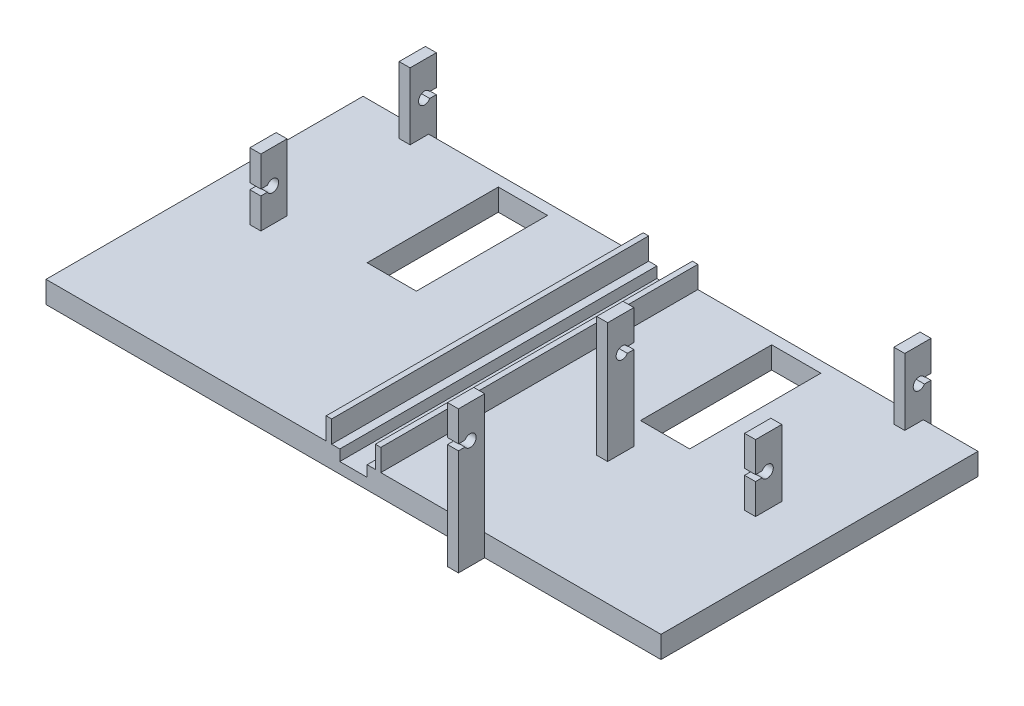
ISO-10303-21;
HEADER;
FILE_DESCRIPTION(('STEP AP214'),'2;1');
FILE_NAME('part.step','',(''),(''),'','','');
FILE_SCHEMA(('AUTOMOTIVE_DESIGN { 1 0 10303 214 1 1 1 1 }'));
ENDSEC;
DATA;
#1=APPLICATION_CONTEXT('core data for automotive mechanical design processes');
#2=APPLICATION_PROTOCOL_DEFINITION('international standard','automotive_design',2000,#1);
#3=PRODUCT_CONTEXT('',#1,'mechanical');
#4=PRODUCT('Part','Part','',(#3));
#5=PRODUCT_RELATED_PRODUCT_CATEGORY('part','',(#4));
#6=PRODUCT_DEFINITION_FORMATION('','',#4);
#7=PRODUCT_DEFINITION_CONTEXT('part definition',#1,'design');
#8=PRODUCT_DEFINITION('design','',#6,#7);
#9=PRODUCT_DEFINITION_SHAPE('','',#8);
#10=(LENGTH_UNIT() NAMED_UNIT(*) SI_UNIT(.MILLI.,.METRE.));
#11=(NAMED_UNIT(*) PLANE_ANGLE_UNIT() SI_UNIT($,.RADIAN.));
#12=(NAMED_UNIT(*) SI_UNIT($,.STERADIAN.) SOLID_ANGLE_UNIT());
#13=UNCERTAINTY_MEASURE_WITH_UNIT(LENGTH_MEASURE(1.E-05),#10,'distance_accuracy_value','');
#14=(GEOMETRIC_REPRESENTATION_CONTEXT(3) GLOBAL_UNCERTAINTY_ASSIGNED_CONTEXT((#13)) GLOBAL_UNIT_ASSIGNED_CONTEXT((#10,
#11,#12)) REPRESENTATION_CONTEXT('',''));
#15=CARTESIAN_POINT('',(0.,0.,0.));
#16=DIRECTION('',(0.,0.,1.));
#17=DIRECTION('',(1.,0.,0.));
#18=AXIS2_PLACEMENT_3D('',#15,#16,#17);
#19=CARTESIAN_POINT('',(0.,4.,0.));
#20=DIRECTION('',(0.,1.,0.));
#21=DIRECTION('',(0.,0.,1.));
#22=AXIS2_PLACEMENT_3D('',#19,#20,#21);
#23=PLANE('',#22);
#24=DIRECTION('',(-1.,0.,0.));
#25=VECTOR('',#24,1.);
#26=CARTESIAN_POINT('',(0.,4.,0.));
#27=LINE('',#26,#25);
#28=CARTESIAN_POINT('',(60.25,4.,0.));
#29=VERTEX_POINT('',#28);
#30=CARTESIAN_POINT('',(58.75,4.,0.));
#31=VERTEX_POINT('',#30);
#32=EDGE_CURVE('E1498',#29,#31,#27,.T.);
#33=ORIENTED_EDGE('',*,*,#32,.T.);
#34=DIRECTION('',(0.,0.,1.));
#35=VECTOR('',#34,1.);
#36=CARTESIAN_POINT('',(58.75,4.,0.));
#37=LINE('',#36,#35);
#38=CARTESIAN_POINT('',(58.75,4.,58.));
#39=VERTEX_POINT('',#38);
#40=EDGE_CURVE('E1469',#31,#39,#37,.T.);
#41=ORIENTED_EDGE('',*,*,#40,.T.);
#42=DIRECTION('',(-1.,0.,0.));
#43=VECTOR('',#42,1.);
#44=CARTESIAN_POINT('',(0.,4.,58.));
#45=LINE('',#44,#43);
#46=CARTESIAN_POINT('',(60.25,4.,58.));
#47=VERTEX_POINT('',#46);
#48=EDGE_CURVE('E601',#47,#39,#45,.T.);
#49=ORIENTED_EDGE('',*,*,#48,.F.);
#50=DIRECTION('',(0.,0.,1.));
#51=VECTOR('',#50,1.);
#52=CARTESIAN_POINT('',(60.25,4.,0.));
#53=LINE('',#52,#51);
#54=EDGE_CURVE('E655',#29,#47,#53,.T.);
#55=ORIENTED_EDGE('',*,*,#54,.F.);
#56=EDGE_LOOP('',(#33,#41,#49,#55));
#57=FACE_BOUND('',#56,.T.);
#58=ADVANCED_FACE('F51',(#57),#23,.T.);
#59=DIRECTION('',(1.,0.,0.));
#60=VECTOR('',#59,1.);
#61=CARTESIAN_POINT('',(10.,4.,30.7));
#62=LINE('',#61,#60);
#63=CARTESIAN_POINT('',(10.,4.,30.7));
#64=VERTEX_POINT('',#63);
#65=CARTESIAN_POINT('',(12.,4.,30.7));
#66=VERTEX_POINT('',#65);
#67=EDGE_CURVE('E1127',#64,#66,#62,.T.);
#68=ORIENTED_EDGE('',*,*,#67,.F.);
#69=DIRECTION('',(0.,0.,1.));
#70=VECTOR('',#69,1.);
#71=CARTESIAN_POINT('',(10.,4.,25.9));
#72=LINE('',#71,#70);
#73=CARTESIAN_POINT('',(10.,4.,25.9));
#74=VERTEX_POINT('',#73);
#75=EDGE_CURVE('E1108',#74,#64,#72,.T.);
#76=ORIENTED_EDGE('',*,*,#75,.F.);
#77=DIRECTION('',(-1.,0.,0.));
#78=VECTOR('',#77,1.);
#79=CARTESIAN_POINT('',(10.,4.,25.9));
#80=LINE('',#79,#78);
#81=CARTESIAN_POINT('',(12.,4.,25.9));
#82=VERTEX_POINT('',#81);
#83=EDGE_CURVE('E1114',#82,#74,#80,.T.);
#84=ORIENTED_EDGE('',*,*,#83,.F.);
#85=DIRECTION('',(0.,0.,-1.));
#86=VECTOR('',#85,1.);
#87=CARTESIAN_POINT('',(12.,4.,25.9));
#88=LINE('',#87,#86);
#89=EDGE_CURVE('E1131',#66,#82,#88,.T.);
#90=ORIENTED_EDGE('',*,*,#89,.F.);
#91=EDGE_LOOP('',(#68,#76,#84,#90));
#92=FACE_BOUND('',#91,.T.);
#93=DIRECTION('',(0.,0.,1.));
#94=VECTOR('',#93,1.);
#95=CARTESIAN_POINT('',(26.75,4.,15.));
#96=LINE('',#95,#94);
#97=CARTESIAN_POINT('',(26.75,4.,2.));
#98=VERTEX_POINT('',#97);
#99=CARTESIAN_POINT('',(26.75,4.,26.));
#100=VERTEX_POINT('',#99);
#101=EDGE_CURVE('E1338',#98,#100,#96,.T.);
#102=ORIENTED_EDGE('',*,*,#101,.F.);
#103=DIRECTION('',(-1.,0.,0.));
#104=VECTOR('',#103,1.);
#105=CARTESIAN_POINT('',(26.75,4.,2.));
#106=LINE('',#105,#104);
#107=CARTESIAN_POINT('',(35.75,4.,2.));
#108=VERTEX_POINT('',#107);
#109=EDGE_CURVE('E878',#108,#98,#106,.T.);
#110=ORIENTED_EDGE('',*,*,#109,.F.);
#111=DIRECTION('',(0.,0.,-1.));
#112=VECTOR('',#111,1.);
#113=CARTESIAN_POINT('',(35.75,4.,15.));
#114=LINE('',#113,#112);
#115=CARTESIAN_POINT('',(35.75,4.,26.));
#116=VERTEX_POINT('',#115);
#117=EDGE_CURVE('E1345',#116,#108,#114,.T.);
#118=ORIENTED_EDGE('',*,*,#117,.F.);
#119=DIRECTION('',(1.,0.,0.));
#120=VECTOR('',#119,1.);
#121=CARTESIAN_POINT('',(26.75,4.,26.));
#122=LINE('',#121,#120);
#123=EDGE_CURVE('E1341',#100,#116,#122,.T.);
#124=ORIENTED_EDGE('',*,*,#123,.F.);
#125=EDGE_LOOP('',(#102,#110,#118,#124));
#126=FACE_BOUND('',#125,.T.);
#127=CARTESIAN_POINT('',(51.25,4.,58.));
#128=VERTEX_POINT('',#127);
#129=CARTESIAN_POINT('',(0.,4.,58.));
#130=VERTEX_POINT('',#129);
#131=EDGE_CURVE('E75',#128,#130,#45,.T.);
#132=ORIENTED_EDGE('',*,*,#131,.F.);
#133=DIRECTION('',(0.,0.,1.));
#134=VECTOR('',#133,1.);
#135=CARTESIAN_POINT('',(51.25,4.,0.));
#136=LINE('',#135,#134);
#137=CARTESIAN_POINT('',(51.25,4.,0.));
#138=VERTEX_POINT('',#137);
#139=EDGE_CURVE('E616',#138,#128,#136,.T.);
#140=ORIENTED_EDGE('',*,*,#139,.F.);
#141=CARTESIAN_POINT('',(12.,4.,0.));
#142=VERTEX_POINT('',#141);
#143=EDGE_CURVE('E1495',#138,#142,#27,.T.);
#144=ORIENTED_EDGE('',*,*,#143,.T.);
#145=DIRECTION('',(0.,0.,-1.));
#146=VECTOR('',#145,1.);
#147=CARTESIAN_POINT('',(12.,4.,-1.4));
#148=LINE('',#147,#146);
#149=CARTESIAN_POINT('',(12.,4.,3.4));
#150=VERTEX_POINT('',#149);
#151=EDGE_CURVE('E1191',#150,#142,#148,.T.);
#152=ORIENTED_EDGE('',*,*,#151,.F.);
#153=DIRECTION('',(1.,0.,0.));
#154=VECTOR('',#153,1.);
#155=CARTESIAN_POINT('',(10.,4.,3.4));
#156=LINE('',#155,#154);
#157=CARTESIAN_POINT('',(10.,4.,3.4));
#158=VERTEX_POINT('',#157);
#159=EDGE_CURVE('E1185',#158,#150,#156,.T.);
#160=ORIENTED_EDGE('',*,*,#159,.F.);
#161=DIRECTION('',(0.,0.,1.));
#162=VECTOR('',#161,1.);
#163=CARTESIAN_POINT('',(10.,4.,-1.4));
#164=LINE('',#163,#162);
#165=CARTESIAN_POINT('',(10.,4.,0.));
#166=VERTEX_POINT('',#165);
#167=EDGE_CURVE('E1203',#166,#158,#164,.T.);
#168=ORIENTED_EDGE('',*,*,#167,.F.);
#169=CARTESIAN_POINT('',(0.,4.,0.));
#170=VERTEX_POINT('',#169);
#171=EDGE_CURVE('E1399',#166,#170,#27,.T.);
#172=ORIENTED_EDGE('',*,*,#171,.T.);
#173=DIRECTION('',(0.,0.,1.));
#174=VECTOR('',#173,1.);
#175=CARTESIAN_POINT('',(0.,4.,0.));
#176=LINE('',#175,#174);
#177=EDGE_CURVE('E1392',#170,#130,#176,.T.);
#178=ORIENTED_EDGE('',*,*,#177,.T.);
#179=EDGE_LOOP('',(#132,#140,#144,#152,#160,#168,#172,#178));
#180=FACE_BOUND('',#179,.T.);
#181=ADVANCED_FACE('F1494',(#92,#126,#180),#23,.T.);
#182=DIRECTION('',(0.,0.,1.));
#183=VECTOR('',#182,1.);
#184=CARTESIAN_POINT('',(53.75,4.,0.));
#185=LINE('',#184,#183);
#186=CARTESIAN_POINT('',(53.75,4.,0.));
#187=VERTEX_POINT('',#186);
#188=CARTESIAN_POINT('',(53.75,4.,58.));
#189=VERTEX_POINT('',#188);
#190=EDGE_CURVE('E596',#187,#189,#185,.T.);
#191=ORIENTED_EDGE('',*,*,#190,.F.);
#192=CARTESIAN_POINT('',(52.25,4.,0.));
#193=VERTEX_POINT('',#192);
#194=EDGE_CURVE('E1406',#187,#193,#27,.T.);
#195=ORIENTED_EDGE('',*,*,#194,.T.);
#196=DIRECTION('',(0.,0.,1.));
#197=VECTOR('',#196,1.);
#198=CARTESIAN_POINT('',(52.25,4.,0.));
#199=LINE('',#198,#197);
#200=CARTESIAN_POINT('',(52.25,4.,58.));
#201=VERTEX_POINT('',#200);
#202=EDGE_CURVE('E627',#193,#201,#199,.T.);
#203=ORIENTED_EDGE('',*,*,#202,.T.);
#204=EDGE_CURVE('E872',#189,#201,#45,.T.);
#205=ORIENTED_EDGE('',*,*,#204,.F.);
#206=EDGE_LOOP('',(#191,#195,#203,#205));
#207=FACE_BOUND('',#206,.T.);
#208=ADVANCED_FACE('F1481',(#207),#23,.T.);
#209=CARTESIAN_POINT('',(78.25,26.,30.7));
#210=DIRECTION('',(0.,0.,1.));
#211=DIRECTION('',(1.,0.,0.));
#212=AXIS2_PLACEMENT_3D('',#209,#210,#211);
#213=PLANE('',#212);
#214=DIRECTION('',(1.,0.,0.));
#215=VECTOR('',#214,1.);
#216=CARTESIAN_POINT('',(78.25,19.35,30.7));
#217=LINE('',#216,#215);
#218=CARTESIAN_POINT('',(78.25,19.35,30.7));
#219=VERTEX_POINT('',#218);
#220=CARTESIAN_POINT('',(80.25,19.35,30.7));
#221=VERTEX_POINT('',#220);
#222=EDGE_CURVE('E715',#219,#221,#217,.T.);
#223=ORIENTED_EDGE('',*,*,#222,.T.);
#224=DIRECTION('',(0.,-1.,0.));
#225=VECTOR('',#224,1.);
#226=CARTESIAN_POINT('',(80.25,26.,30.7));
#227=LINE('',#226,#225);
#228=CARTESIAN_POINT('',(80.25,4.,30.7));
#229=VERTEX_POINT('',#228);
#230=EDGE_CURVE('E763',#221,#229,#227,.T.);
#231=ORIENTED_EDGE('',*,*,#230,.T.);
#232=DIRECTION('',(-1.,0.,0.));
#233=VECTOR('',#232,1.);
#234=CARTESIAN_POINT('',(78.25,4.,30.7));
#235=LINE('',#234,#233);
#236=CARTESIAN_POINT('',(78.25,4.,30.7));
#237=VERTEX_POINT('',#236);
#238=EDGE_CURVE('E774',#229,#237,#235,.T.);
#239=ORIENTED_EDGE('',*,*,#238,.T.);
#240=DIRECTION('',(0.,-1.,0.));
#241=VECTOR('',#240,1.);
#242=CARTESIAN_POINT('',(78.25,26.,30.7));
#243=LINE('',#242,#241);
#244=EDGE_CURVE('E768',#219,#237,#243,.T.);
#245=ORIENTED_EDGE('',*,*,#244,.F.);
#246=EDGE_LOOP('',(#223,#231,#239,#245));
#247=FACE_BOUND('',#246,.T.);
#248=ADVANCED_FACE('F1655',(#247),#213,.F.);
#249=CARTESIAN_POINT('',(0.,0.,62.8));
#250=DIRECTION('',(0.,0.,1.));
#251=DIRECTION('',(1.,0.,0.));
#252=AXIS2_PLACEMENT_3D('',#249,#250,#251);
#253=PLANE('',#252);
#254=DIRECTION('',(0.,-1.,0.));
#255=VECTOR('',#254,1.);
#256=CARTESIAN_POINT('',(78.25,4.,62.8));
#257=LINE('',#256,#255);
#258=CARTESIAN_POINT('',(78.25,26.,62.8));
#259=VERTEX_POINT('',#258);
#260=CARTESIAN_POINT('',(78.25,20.45,62.8));
#261=VERTEX_POINT('',#260);
#262=EDGE_CURVE('E826',#259,#261,#257,.T.);
#263=ORIENTED_EDGE('',*,*,#262,.T.);
#264=DIRECTION('',(1.,0.,0.));
#265=VECTOR('',#264,1.);
#266=CARTESIAN_POINT('',(78.25,20.45,62.8));
#267=LINE('',#266,#265);
#268=CARTESIAN_POINT('',(80.25,20.45,62.8));
#269=VERTEX_POINT('',#268);
#270=EDGE_CURVE('E751',#261,#269,#267,.T.);
#271=ORIENTED_EDGE('',*,*,#270,.T.);
#272=DIRECTION('',(0.,1.,0.));
#273=VECTOR('',#272,1.);
#274=CARTESIAN_POINT('',(80.25,4.,62.8));
#275=LINE('',#274,#273);
#276=CARTESIAN_POINT('',(80.25,26.,62.8));
#277=VERTEX_POINT('',#276);
#278=EDGE_CURVE('E834',#269,#277,#275,.T.);
#279=ORIENTED_EDGE('',*,*,#278,.T.);
#280=DIRECTION('',(1.,0.,0.));
#281=VECTOR('',#280,1.);
#282=CARTESIAN_POINT('',(78.25,26.,62.8));
#283=LINE('',#282,#281);
#284=EDGE_CURVE('E806',#259,#277,#283,.T.);
#285=ORIENTED_EDGE('',*,*,#284,.F.);
#286=EDGE_LOOP('',(#263,#271,#279,#285));
#287=FACE_BOUND('',#286,.T.);
#288=ADVANCED_FACE('F1648',(#287),#253,.T.);
#289=DIRECTION('',(0.,0.,1.));
#290=VECTOR('',#289,1.);
#291=CARTESIAN_POINT('',(61.25,4.,0.));
#292=LINE('',#291,#290);
#293=CARTESIAN_POINT('',(61.25,4.,0.));
#294=VERTEX_POINT('',#293);
#295=CARTESIAN_POINT('',(61.25,4.,58.));
#296=VERTEX_POINT('',#295);
#297=EDGE_CURVE('E649',#294,#296,#292,.T.);
#298=ORIENTED_EDGE('',*,*,#297,.T.);
#299=CARTESIAN_POINT('',(78.25,4.,58.));
#300=VERTEX_POINT('',#299);
#301=EDGE_CURVE('E871',#300,#296,#45,.T.);
#302=ORIENTED_EDGE('',*,*,#301,.F.);
#303=DIRECTION('',(-1.,0.,0.));
#304=VECTOR('',#303,1.);
#305=CARTESIAN_POINT('',(78.25,4.,58.));
#306=LINE('',#305,#304);
#307=CARTESIAN_POINT('',(80.25,4.,58.));
#308=VERTEX_POINT('',#307);
#309=EDGE_CURVE('E790',#308,#300,#306,.T.);
#310=ORIENTED_EDGE('',*,*,#309,.F.);
#311=CARTESIAN_POINT('',(112.5,4.,58.));
#312=VERTEX_POINT('',#311);
#313=EDGE_CURVE('E866',#312,#308,#45,.T.);
#314=ORIENTED_EDGE('',*,*,#313,.F.);
#315=DIRECTION('',(0.,0.,-1.));
#316=VECTOR('',#315,1.);
#317=CARTESIAN_POINT('',(112.5,4.,0.));
#318=LINE('',#317,#316);
#319=CARTESIAN_POINT('',(112.5,4.,0.));
#320=VERTEX_POINT('',#319);
#321=EDGE_CURVE('E1395',#312,#320,#318,.T.);
#322=ORIENTED_EDGE('',*,*,#321,.T.);
#323=CARTESIAN_POINT('',(102.5,4.,0.));
#324=VERTEX_POINT('',#323);
#325=EDGE_CURVE('E1400',#320,#324,#27,.T.);
#326=ORIENTED_EDGE('',*,*,#325,.T.);
#327=DIRECTION('',(0.,0.,1.));
#328=VECTOR('',#327,1.);
#329=CARTESIAN_POINT('',(102.5,4.,-1.4));
#330=LINE('',#329,#328);
#331=CARTESIAN_POINT('',(102.5,4.,3.4));
#332=VERTEX_POINT('',#331);
#333=EDGE_CURVE('E1010',#324,#332,#330,.T.);
#334=ORIENTED_EDGE('',*,*,#333,.T.);
#335=DIRECTION('',(-1.,0.,0.));
#336=VECTOR('',#335,1.);
#337=CARTESIAN_POINT('',(102.5,4.,3.4));
#338=LINE('',#337,#336);
#339=CARTESIAN_POINT('',(100.5,4.,3.4));
#340=VERTEX_POINT('',#339);
#341=EDGE_CURVE('E1016',#332,#340,#338,.T.);
#342=ORIENTED_EDGE('',*,*,#341,.T.);
#343=DIRECTION('',(0.,0.,-1.));
#344=VECTOR('',#343,1.);
#345=CARTESIAN_POINT('',(100.5,4.,-1.4));
#346=LINE('',#345,#344);
#347=CARTESIAN_POINT('',(100.5,4.,0.));
#348=VERTEX_POINT('',#347);
#349=EDGE_CURVE('E1031',#340,#348,#346,.T.);
#350=ORIENTED_EDGE('',*,*,#349,.T.);
#351=EDGE_CURVE('E1405',#348,#294,#27,.T.);
#352=ORIENTED_EDGE('',*,*,#351,.T.);
#353=EDGE_LOOP('',(#298,#302,#310,#314,#322,#326,#334,#342,#350,#352));
#354=FACE_BOUND('',#353,.T.);
#355=DIRECTION('',(-1.,0.,0.));
#356=VECTOR('',#355,1.);
#357=CARTESIAN_POINT('',(85.75,4.,2.));
#358=LINE('',#357,#356);
#359=CARTESIAN_POINT('',(85.75,4.,2.));
#360=VERTEX_POINT('',#359);
#361=CARTESIAN_POINT('',(76.75,4.,2.));
#362=VERTEX_POINT('',#361);
#363=EDGE_CURVE('E882',#360,#362,#358,.T.);
#364=ORIENTED_EDGE('',*,*,#363,.F.);
#365=DIRECTION('',(0.,0.,-1.));
#366=VECTOR('',#365,1.);
#367=CARTESIAN_POINT('',(85.75,4.,15.));
#368=LINE('',#367,#366);
#369=CARTESIAN_POINT('',(85.75,4.,26.));
#370=VERTEX_POINT('',#369);
#371=EDGE_CURVE('E1373',#370,#360,#368,.T.);
#372=ORIENTED_EDGE('',*,*,#371,.F.);
#373=DIRECTION('',(1.,0.,0.));
#374=VECTOR('',#373,1.);
#375=CARTESIAN_POINT('',(76.75,4.,26.));
#376=LINE('',#375,#374);
#377=CARTESIAN_POINT('',(76.75,4.,26.));
#378=VERTEX_POINT('',#377);
#379=EDGE_CURVE('E1387',#378,#370,#376,.T.);
#380=ORIENTED_EDGE('',*,*,#379,.F.);
#381=DIRECTION('',(0.,0.,1.));
#382=VECTOR('',#381,1.);
#383=CARTESIAN_POINT('',(76.75,4.,15.));
#384=LINE('',#383,#382);
#385=EDGE_CURVE('E1378',#362,#378,#384,.T.);
#386=ORIENTED_EDGE('',*,*,#385,.F.);
#387=EDGE_LOOP('',(#364,#372,#380,#386));
#388=FACE_BOUND('',#387,.T.);
#389=DIRECTION('',(0.,0.,1.));
#390=VECTOR('',#389,1.);
#391=CARTESIAN_POINT('',(102.5,4.,25.9));
#392=LINE('',#391,#390);
#393=CARTESIAN_POINT('',(102.5,4.,25.9));
#394=VERTEX_POINT('',#393);
#395=CARTESIAN_POINT('',(102.5,4.,30.7));
#396=VERTEX_POINT('',#395);
#397=EDGE_CURVE('E929',#394,#396,#392,.T.);
#398=ORIENTED_EDGE('',*,*,#397,.T.);
#399=DIRECTION('',(-1.,0.,0.));
#400=VECTOR('',#399,1.);
#401=CARTESIAN_POINT('',(102.5,4.,30.7));
#402=LINE('',#401,#400);
#403=CARTESIAN_POINT('',(100.5,4.,30.7));
#404=VERTEX_POINT('',#403);
#405=EDGE_CURVE('E935',#396,#404,#402,.T.);
#406=ORIENTED_EDGE('',*,*,#405,.T.);
#407=DIRECTION('',(0.,0.,-1.));
#408=VECTOR('',#407,1.);
#409=CARTESIAN_POINT('',(100.5,4.,25.9));
#410=LINE('',#409,#408);
#411=CARTESIAN_POINT('',(100.5,4.,25.9));
#412=VERTEX_POINT('',#411);
#413=EDGE_CURVE('E954',#404,#412,#410,.T.);
#414=ORIENTED_EDGE('',*,*,#413,.T.);
#415=DIRECTION('',(1.,0.,0.));
#416=VECTOR('',#415,1.);
#417=CARTESIAN_POINT('',(102.5,4.,25.9));
#418=LINE('',#417,#416);
#419=EDGE_CURVE('E951',#412,#394,#418,.T.);
#420=ORIENTED_EDGE('',*,*,#419,.T.);
#421=EDGE_LOOP('',(#398,#406,#414,#420));
#422=FACE_BOUND('',#421,.T.);
#423=DIRECTION('',(1.,0.,0.));
#424=VECTOR('',#423,1.);
#425=CARTESIAN_POINT('',(78.25,4.,35.5));
#426=LINE('',#425,#424);
#427=CARTESIAN_POINT('',(78.25,4.,35.5));
#428=VERTEX_POINT('',#427);
#429=CARTESIAN_POINT('',(80.25,4.,35.5));
#430=VERTEX_POINT('',#429);
#431=EDGE_CURVE('E783',#428,#430,#426,.T.);
#432=ORIENTED_EDGE('',*,*,#431,.F.);
#433=DIRECTION('',(0.,0.,1.));
#434=VECTOR('',#433,1.);
#435=CARTESIAN_POINT('',(78.25,4.,30.7));
#436=LINE('',#435,#434);
#437=EDGE_CURVE('E786',#237,#428,#436,.T.);
#438=ORIENTED_EDGE('',*,*,#437,.F.);
#439=ORIENTED_EDGE('',*,*,#238,.F.);
#440=DIRECTION('',(0.,0.,-1.));
#441=VECTOR('',#440,1.);
#442=CARTESIAN_POINT('',(80.25,4.,30.7));
#443=LINE('',#442,#441);
#444=EDGE_CURVE('E778',#430,#229,#443,.T.);
#445=ORIENTED_EDGE('',*,*,#444,.F.);
#446=EDGE_LOOP('',(#432,#438,#439,#445));
#447=FACE_BOUND('',#446,.T.);
#448=ADVANCED_FACE('F1532',(#354,#388,#422,#447),#23,.T.);
#449=CARTESIAN_POINT('',(0.,0.,58.));
#450=DIRECTION('',(0.,0.,-1.));
#451=DIRECTION('',(-1.,0.,0.));
#452=AXIS2_PLACEMENT_3D('',#449,#450,#451);
#453=PLANE('',#452);
#454=DIRECTION('',(1.,0.,0.));
#455=VECTOR('',#454,1.);
#456=CARTESIAN_POINT('',(53.75,2.,58.));
#457=LINE('',#456,#455);
#458=CARTESIAN_POINT('',(53.75,2.,58.));
#459=VERTEX_POINT('',#458);
#460=CARTESIAN_POINT('',(58.75,2.,58.));
#461=VERTEX_POINT('',#460);
#462=EDGE_CURVE('E586',#459,#461,#457,.T.);
#463=ORIENTED_EDGE('',*,*,#462,.F.);
#464=DIRECTION('',(0.,1.,0.));
#465=VECTOR('',#464,1.);
#466=CARTESIAN_POINT('',(53.75,2.,58.));
#467=LINE('',#466,#465);
#468=EDGE_CURVE('E631',#459,#189,#467,.T.);
#469=ORIENTED_EDGE('',*,*,#468,.T.);
#470=ORIENTED_EDGE('',*,*,#204,.T.);
#471=DIRECTION('',(0.,-1.,0.));
#472=VECTOR('',#471,1.);
#473=CARTESIAN_POINT('',(52.25,8.,58.));
#474=LINE('',#473,#472);
#475=CARTESIAN_POINT('',(52.25,8.,58.));
#476=VERTEX_POINT('',#475);
#477=EDGE_CURVE('E626',#476,#201,#474,.T.);
#478=ORIENTED_EDGE('',*,*,#477,.F.);
#479=DIRECTION('',(1.,0.,0.));
#480=VECTOR('',#479,1.);
#481=CARTESIAN_POINT('',(0.,8.,58.));
#482=LINE('',#481,#480);
#483=CARTESIAN_POINT('',(51.25,8.,58.));
#484=VERTEX_POINT('',#483);
#485=EDGE_CURVE('E623',#484,#476,#482,.T.);
#486=ORIENTED_EDGE('',*,*,#485,.F.);
#487=DIRECTION('',(0.,-1.,0.));
#488=VECTOR('',#487,1.);
#489=CARTESIAN_POINT('',(51.25,8.,58.));
#490=LINE('',#489,#488);
#491=EDGE_CURVE('E637',#484,#128,#490,.T.);
#492=ORIENTED_EDGE('',*,*,#491,.T.);
#493=ORIENTED_EDGE('',*,*,#131,.T.);
#494=DIRECTION('',(0.,-1.,0.));
#495=VECTOR('',#494,1.);
#496=CARTESIAN_POINT('',(0.,0.,58.));
#497=LINE('',#496,#495);
#498=CARTESIAN_POINT('',(0.,0.,58.));
#499=VERTEX_POINT('',#498);
#500=EDGE_CURVE('E854',#130,#499,#497,.T.);
#501=ORIENTED_EDGE('',*,*,#500,.T.);
#502=DIRECTION('',(1.,0.,0.));
#503=VECTOR('',#502,1.);
#504=CARTESIAN_POINT('',(0.,0.,58.));
#505=LINE('',#504,#503);
#506=CARTESIAN_POINT('',(78.25,0.,58.));
#507=VERTEX_POINT('',#506);
#508=EDGE_CURVE('E859',#499,#507,#505,.T.);
#509=ORIENTED_EDGE('',*,*,#508,.T.);
#510=DIRECTION('',(0.,-1.,0.));
#511=VECTOR('',#510,1.);
#512=CARTESIAN_POINT('',(78.25,4.,58.));
#513=LINE('',#512,#511);
#514=EDGE_CURVE('E825',#300,#507,#513,.T.);
#515=ORIENTED_EDGE('',*,*,#514,.F.);
#516=ORIENTED_EDGE('',*,*,#301,.T.);
#517=DIRECTION('',(0.,-1.,0.));
#518=VECTOR('',#517,1.);
#519=CARTESIAN_POINT('',(61.25,8.,58.));
#520=LINE('',#519,#518);
#521=CARTESIAN_POINT('',(61.25,8.,58.));
#522=VERTEX_POINT('',#521);
#523=EDGE_CURVE('E665',#522,#296,#520,.T.);
#524=ORIENTED_EDGE('',*,*,#523,.F.);
#525=DIRECTION('',(1.,0.,0.));
#526=VECTOR('',#525,1.);
#527=CARTESIAN_POINT('',(0.,8.,58.));
#528=LINE('',#527,#526);
#529=CARTESIAN_POINT('',(60.25,8.,58.));
#530=VERTEX_POINT('',#529);
#531=EDGE_CURVE('E662',#530,#522,#528,.T.);
#532=ORIENTED_EDGE('',*,*,#531,.F.);
#533=DIRECTION('',(0.,-1.,0.));
#534=VECTOR('',#533,1.);
#535=CARTESIAN_POINT('',(60.25,8.,58.));
#536=LINE('',#535,#534);
#537=EDGE_CURVE('E674',#530,#47,#536,.T.);
#538=ORIENTED_EDGE('',*,*,#537,.T.);
#539=ORIENTED_EDGE('',*,*,#48,.T.);
#540=DIRECTION('',(0.,1.,0.));
#541=VECTOR('',#540,1.);
#542=CARTESIAN_POINT('',(58.75,2.,58.));
#543=LINE('',#542,#541);
#544=EDGE_CURVE('E579',#461,#39,#543,.T.);
#545=ORIENTED_EDGE('',*,*,#544,.F.);
#546=EDGE_LOOP('',(#463,#469,#470,#478,#486,#492,#493,#501,#509,#515,#516,#524,#532,#538,#539,#545));
#547=FACE_BOUND('',#546,.T.);
#548=ADVANCED_FACE('F599',(#547),#453,.F.);
#549=DIRECTION('',(0.,1.,0.));
#550=VECTOR('',#549,1.);
#551=CARTESIAN_POINT('',(80.25,4.,58.));
#552=LINE('',#551,#550);
#553=CARTESIAN_POINT('',(80.25,0.,58.));
#554=VERTEX_POINT('',#553);
#555=EDGE_CURVE('E843',#554,#308,#552,.T.);
#556=ORIENTED_EDGE('',*,*,#555,.F.);
#557=CARTESIAN_POINT('',(112.5,0.,58.));
#558=VERTEX_POINT('',#557);
#559=EDGE_CURVE('E858',#554,#558,#505,.T.);
#560=ORIENTED_EDGE('',*,*,#559,.T.);
#561=DIRECTION('',(0.,1.,0.));
#562=VECTOR('',#561,1.);
#563=CARTESIAN_POINT('',(112.5,0.,58.));
#564=LINE('',#563,#562);
#565=EDGE_CURVE('E862',#558,#312,#564,.T.);
#566=ORIENTED_EDGE('',*,*,#565,.T.);
#567=ORIENTED_EDGE('',*,*,#313,.T.);
#568=EDGE_LOOP('',(#556,#560,#566,#567));
#569=FACE_BOUND('',#568,.T.);
#570=ADVANCED_FACE('F1550',(#569),#453,.F.);
#571=CARTESIAN_POINT('',(102.5,16.2,30.7));
#572=DIRECTION('',(0.,0.,1.));
#573=DIRECTION('',(1.,0.,0.));
#574=AXIS2_PLACEMENT_3D('',#571,#572,#573);
#575=PLANE('',#574);
#576=DIRECTION('',(0.,-1.,0.));
#577=VECTOR('',#576,1.);
#578=CARTESIAN_POINT('',(100.5,16.2,30.7));
#579=LINE('',#578,#577);
#580=CARTESIAN_POINT('',(100.5,16.2,30.7));
#581=VERTEX_POINT('',#580);
#582=CARTESIAN_POINT('',(100.5,10.65,30.7));
#583=VERTEX_POINT('',#582);
#584=EDGE_CURVE('E965',#581,#583,#579,.T.);
#585=ORIENTED_EDGE('',*,*,#584,.T.);
#586=DIRECTION('',(1.,0.,0.));
#587=VECTOR('',#586,1.);
#588=CARTESIAN_POINT('',(102.5,10.65,30.7));
#589=LINE('',#588,#587);
#590=CARTESIAN_POINT('',(102.5,10.65,30.7));
#591=VERTEX_POINT('',#590);
#592=EDGE_CURVE('E1429',#583,#591,#589,.T.);
#593=ORIENTED_EDGE('',*,*,#592,.T.);
#594=DIRECTION('',(0.,-1.,0.));
#595=VECTOR('',#594,1.);
#596=CARTESIAN_POINT('',(102.5,16.2,30.7));
#597=LINE('',#596,#595);
#598=CARTESIAN_POINT('',(102.5,16.2,30.7));
#599=VERTEX_POINT('',#598);
#600=EDGE_CURVE('E960',#599,#591,#597,.T.);
#601=ORIENTED_EDGE('',*,*,#600,.F.);
#602=DIRECTION('',(-1.,0.,0.));
#603=VECTOR('',#602,1.);
#604=CARTESIAN_POINT('',(102.5,16.2,30.7));
#605=LINE('',#604,#603);
#606=EDGE_CURVE('E943',#599,#581,#605,.T.);
#607=ORIENTED_EDGE('',*,*,#606,.T.);
#608=EDGE_LOOP('',(#585,#593,#601,#607));
#609=FACE_BOUND('',#608,.T.);
#610=ADVANCED_FACE('F1621',(#609),#575,.T.);
#611=CARTESIAN_POINT('',(112.5,0.,-1.4));
#612=DIRECTION('',(0.,0.,-1.));
#613=DIRECTION('',(1.,0.,0.));
#614=AXIS2_PLACEMENT_3D('',#611,#612,#613);
#615=PLANE('',#614);
#616=DIRECTION('',(0.,-1.,0.));
#617=VECTOR('',#616,1.);
#618=CARTESIAN_POINT('',(100.5,4.,-1.4));
#619=LINE('',#618,#617);
#620=CARTESIAN_POINT('',(100.5,9.55,-1.4));
#621=VERTEX_POINT('',#620);
#622=CARTESIAN_POINT('',(100.5,0.,-1.4));
#623=VERTEX_POINT('',#622);
#624=EDGE_CURVE('E1049',#621,#623,#619,.T.);
#625=ORIENTED_EDGE('',*,*,#624,.F.);
#626=DIRECTION('',(1.,0.,0.));
#627=VECTOR('',#626,1.);
#628=CARTESIAN_POINT('',(8.07539810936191,9.55,-1.40000000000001));
#629=LINE('',#628,#627);
#630=CARTESIAN_POINT('',(102.5,9.55,-1.4));
#631=VERTEX_POINT('',#630);
#632=EDGE_CURVE('E994',#621,#631,#629,.T.);
#633=ORIENTED_EDGE('',*,*,#632,.T.);
#634=DIRECTION('',(0.,1.,0.));
#635=VECTOR('',#634,1.);
#636=CARTESIAN_POINT('',(102.5,4.,-1.4));
#637=LINE('',#636,#635);
#638=CARTESIAN_POINT('',(102.5,0.,-1.4));
#639=VERTEX_POINT('',#638);
#640=EDGE_CURVE('E1050',#639,#631,#637,.T.);
#641=ORIENTED_EDGE('',*,*,#640,.F.);
#642=DIRECTION('',(1.,0.,0.));
#643=VECTOR('',#642,1.);
#644=CARTESIAN_POINT('',(100.5,0.,-1.4));
#645=LINE('',#644,#643);
#646=EDGE_CURVE('E1054',#623,#639,#645,.T.);
#647=ORIENTED_EDGE('',*,*,#646,.F.);
#648=EDGE_LOOP('',(#625,#633,#641,#647));
#649=FACE_BOUND('',#648,.T.);
#650=ADVANCED_FACE('F1588',(#649),#615,.T.);
#651=CARTESIAN_POINT('',(0.,4.,0.));
#652=DIRECTION('',(0.,0.,1.));
#653=DIRECTION('',(1.,0.,0.));
#654=AXIS2_PLACEMENT_3D('',#651,#652,#653);
#655=PLANE('',#654);
#656=ORIENTED_EDGE('',*,*,#194,.F.);
#657=DIRECTION('',(0.,1.,0.));
#658=VECTOR('',#657,1.);
#659=CARTESIAN_POINT('',(53.75,2.,0.));
#660=LINE('',#659,#658);
#661=CARTESIAN_POINT('',(53.75,2.,0.));
#662=VERTEX_POINT('',#661);
#663=EDGE_CURVE('E606',#662,#187,#660,.T.);
#664=ORIENTED_EDGE('',*,*,#663,.F.);
#665=DIRECTION('',(1.,0.,0.));
#666=VECTOR('',#665,1.);
#667=CARTESIAN_POINT('',(53.75,2.,0.));
#668=LINE('',#667,#666);
#669=CARTESIAN_POINT('',(58.75,2.,0.));
#670=VERTEX_POINT('',#669);
#671=EDGE_CURVE('E585',#662,#670,#668,.T.);
#672=ORIENTED_EDGE('',*,*,#671,.T.);
#673=DIRECTION('',(0.,1.,0.));
#674=VECTOR('',#673,1.);
#675=CARTESIAN_POINT('',(58.75,2.,0.));
#676=LINE('',#675,#674);
#677=EDGE_CURVE('E582',#670,#31,#676,.T.);
#678=ORIENTED_EDGE('',*,*,#677,.T.);
#679=ORIENTED_EDGE('',*,*,#32,.F.);
#680=DIRECTION('',(0.,-1.,0.));
#681=VECTOR('',#680,1.);
#682=CARTESIAN_POINT('',(60.25,8.,0.));
#683=LINE('',#682,#681);
#684=CARTESIAN_POINT('',(60.25,8.,0.));
#685=VERTEX_POINT('',#684);
#686=EDGE_CURVE('E677',#685,#29,#683,.T.);
#687=ORIENTED_EDGE('',*,*,#686,.F.);
#688=DIRECTION('',(1.,0.,0.));
#689=VECTOR('',#688,1.);
#690=CARTESIAN_POINT('',(0.,8.,0.));
#691=LINE('',#690,#689);
#692=CARTESIAN_POINT('',(61.25,8.,0.));
#693=VERTEX_POINT('',#692);
#694=EDGE_CURVE('E654',#685,#693,#691,.T.);
#695=ORIENTED_EDGE('',*,*,#694,.T.);
#696=DIRECTION('',(0.,-1.,0.));
#697=VECTOR('',#696,1.);
#698=CARTESIAN_POINT('',(61.25,8.,0.));
#699=LINE('',#698,#697);
#700=EDGE_CURVE('E681',#693,#294,#699,.T.);
#701=ORIENTED_EDGE('',*,*,#700,.T.);
#702=ORIENTED_EDGE('',*,*,#351,.F.);
#703=DIRECTION('',(0.,-1.,0.));
#704=VECTOR('',#703,1.);
#705=CARTESIAN_POINT('',(100.5,4.,0.));
#706=LINE('',#705,#704);
#707=CARTESIAN_POINT('',(100.5,0.,0.));
#708=VERTEX_POINT('',#707);
#709=EDGE_CURVE('E1043',#348,#708,#706,.T.);
#710=ORIENTED_EDGE('',*,*,#709,.T.);
#711=DIRECTION('',(-1.,0.,0.));
#712=VECTOR('',#711,1.);
#713=CARTESIAN_POINT('',(0.,0.,0.));
#714=LINE('',#713,#712);
#715=CARTESIAN_POINT('',(12.,0.,0.));
#716=VERTEX_POINT('',#715);
#717=EDGE_CURVE('E1415',#708,#716,#714,.T.);
#718=ORIENTED_EDGE('',*,*,#717,.T.);
#719=DIRECTION('',(0.,-1.,0.));
#720=VECTOR('',#719,1.);
#721=CARTESIAN_POINT('',(12.,4.,0.));
#722=LINE('',#721,#720);
#723=EDGE_CURVE('E1222',#142,#716,#722,.T.);
#724=ORIENTED_EDGE('',*,*,#723,.F.);
#725=ORIENTED_EDGE('',*,*,#143,.F.);
#726=DIRECTION('',(0.,-1.,0.));
#727=VECTOR('',#726,1.);
#728=CARTESIAN_POINT('',(51.25,8.,0.));
#729=LINE('',#728,#727);
#730=CARTESIAN_POINT('',(51.25,8.,0.));
#731=VERTEX_POINT('',#730);
#732=EDGE_CURVE('E641',#731,#138,#729,.T.);
#733=ORIENTED_EDGE('',*,*,#732,.F.);
#734=DIRECTION('',(1.,0.,0.));
#735=VECTOR('',#734,1.);
#736=CARTESIAN_POINT('',(0.,8.,0.));
#737=LINE('',#736,#735);
#738=CARTESIAN_POINT('',(52.25,8.,0.));
#739=VERTEX_POINT('',#738);
#740=EDGE_CURVE('E615',#731,#739,#737,.T.);
#741=ORIENTED_EDGE('',*,*,#740,.T.);
#742=DIRECTION('',(0.,-1.,0.));
#743=VECTOR('',#742,1.);
#744=CARTESIAN_POINT('',(52.25,8.,0.));
#745=LINE('',#744,#743);
#746=EDGE_CURVE('E645',#739,#193,#745,.T.);
#747=ORIENTED_EDGE('',*,*,#746,.T.);
#748=EDGE_LOOP('',(#656,#664,#672,#678,#679,#687,#695,#701,#702,#710,#718,#724,#725,#733,#741,#747));
#749=FACE_BOUND('',#748,.T.);
#750=ADVANCED_FACE('F1475',(#749),#655,.F.);
#751=CARTESIAN_POINT('',(10.,16.2,30.7));
#752=DIRECTION('',(0.,0.,-1.));
#753=DIRECTION('',(-1.,0.,0.));
#754=AXIS2_PLACEMENT_3D('',#751,#752,#753);
#755=PLANE('',#754);
#756=DIRECTION('',(-1.,0.,0.));
#757=VECTOR('',#756,1.);
#758=CARTESIAN_POINT('',(15.9246018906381,9.55,30.7));
#759=LINE('',#758,#757);
#760=CARTESIAN_POINT('',(12.,9.55,30.7));
#761=VERTEX_POINT('',#760);
#762=CARTESIAN_POINT('',(10.,9.55,30.7));
#763=VERTEX_POINT('',#762);
#764=EDGE_CURVE('E1089',#761,#763,#759,.T.);
#765=ORIENTED_EDGE('',*,*,#764,.T.);
#766=DIRECTION('',(0.,-1.,0.));
#767=VECTOR('',#766,1.);
#768=CARTESIAN_POINT('',(10.,16.2,30.7));
#769=LINE('',#768,#767);
#770=EDGE_CURVE('E1148',#763,#64,#769,.T.);
#771=ORIENTED_EDGE('',*,*,#770,.T.);
#772=ORIENTED_EDGE('',*,*,#67,.T.);
#773=DIRECTION('',(0.,-1.,0.));
#774=VECTOR('',#773,1.);
#775=CARTESIAN_POINT('',(12.,16.2,30.7));
#776=LINE('',#775,#774);
#777=EDGE_CURVE('E1143',#761,#66,#776,.T.);
#778=ORIENTED_EDGE('',*,*,#777,.F.);
#779=EDGE_LOOP('',(#765,#771,#772,#778));
#780=FACE_BOUND('',#779,.T.);
#781=ADVANCED_FACE('F1870',(#780),#755,.F.);
#782=CARTESIAN_POINT('',(12.,4.,-1.4));
#783=DIRECTION('',(-1.,0.,0.));
#784=DIRECTION('',(0.,-1.,0.));
#785=AXIS2_PLACEMENT_3D('',#782,#783,#784);
#786=PLANE('',#785);
#787=DIRECTION('',(0.,0.,-1.));
#788=VECTOR('',#787,1.);
#789=CARTESIAN_POINT('',(12.,10.65,0.));
#790=LINE('',#789,#788);
#791=CARTESIAN_POINT('',(12.,10.65,-0.202627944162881));
#792=VERTEX_POINT('',#791);
#793=CARTESIAN_POINT('',(12.,10.65,-1.4));
#794=VERTEX_POINT('',#793);
#795=EDGE_CURVE('E1158',#792,#794,#790,.T.);
#796=ORIENTED_EDGE('',*,*,#795,.T.);
#797=DIRECTION('',(0.,-1.,0.));
#798=VECTOR('',#797,1.);
#799=CARTESIAN_POINT('',(12.,4.,-1.4));
#800=LINE('',#799,#798);
#801=CARTESIAN_POINT('',(12.,16.2,-1.4));
#802=VERTEX_POINT('',#801);
#803=EDGE_CURVE('E1223',#802,#794,#800,.T.);
#804=ORIENTED_EDGE('',*,*,#803,.F.);
#805=DIRECTION('',(0.,0.,-1.));
#806=VECTOR('',#805,1.);
#807=CARTESIAN_POINT('',(12.,16.2,-1.4));
#808=LINE('',#807,#806);
#809=CARTESIAN_POINT('',(12.,16.2,3.4));
#810=VERTEX_POINT('',#809);
#811=EDGE_CURVE('E1194',#810,#802,#808,.T.);
#812=ORIENTED_EDGE('',*,*,#811,.F.);
#813=DIRECTION('',(0.,-1.,0.));
#814=VECTOR('',#813,1.);
#815=CARTESIAN_POINT('',(12.,16.2,3.4));
#816=LINE('',#815,#814);
#817=EDGE_CURVE('E1202',#810,#150,#816,.T.);
#818=ORIENTED_EDGE('',*,*,#817,.T.);
#819=ORIENTED_EDGE('',*,*,#151,.T.);
#820=ORIENTED_EDGE('',*,*,#723,.T.);
#821=DIRECTION('',(0.,0.,1.));
#822=VECTOR('',#821,1.);
#823=CARTESIAN_POINT('',(12.,0.,-1.4));
#824=LINE('',#823,#822);
#825=CARTESIAN_POINT('',(12.,0.,-1.4));
#826=VERTEX_POINT('',#825);
#827=EDGE_CURVE('E1247',#826,#716,#824,.T.);
#828=ORIENTED_EDGE('',*,*,#827,.F.);
#829=CARTESIAN_POINT('',(12.,9.55,-1.4));
#830=VERTEX_POINT('',#829);
#831=EDGE_CURVE('E1228',#830,#826,#800,.T.);
#832=ORIENTED_EDGE('',*,*,#831,.F.);
#833=DIRECTION('',(0.,0.,-1.));
#834=VECTOR('',#833,1.);
#835=CARTESIAN_POINT('',(12.,9.55,0.));
#836=LINE('',#835,#834);
#837=CARTESIAN_POINT('',(12.,9.55,-0.202627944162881));
#838=VERTEX_POINT('',#837);
#839=EDGE_CURVE('E1154',#838,#830,#836,.T.);
#840=ORIENTED_EDGE('',*,*,#839,.F.);
#841=CARTESIAN_POINT('',(12.,10.1,0.75));
#842=DIRECTION('',(-1.,0.,0.));
#843=DIRECTION('',(0.,-1.,0.));
#844=AXIS2_PLACEMENT_3D('',#841,#842,#843);
#845=CIRCLE('',#844,1.1);
#846=EDGE_CURVE('E1157',#792,#838,#845,.F.);
#847=ORIENTED_EDGE('',*,*,#846,.F.);
#848=EDGE_LOOP('',(#796,#804,#812,#818,#819,#820,#828,#832,#840,#847));
#849=FACE_BOUND('',#848,.T.);
#850=ADVANCED_FACE('F1501',(#849),#786,.F.);
#851=CARTESIAN_POINT('',(10.,4.,-1.4));
#852=DIRECTION('',(1.,0.,0.));
#853=DIRECTION('',(0.,1.,0.));
#854=AXIS2_PLACEMENT_3D('',#851,#852,#853);
#855=PLANE('',#854);
#856=DIRECTION('',(0.,0.,-1.));
#857=VECTOR('',#856,1.);
#858=CARTESIAN_POINT('',(10.,10.65,-1.40000000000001));
#859=LINE('',#858,#857);
#860=CARTESIAN_POINT('',(10.,10.65,-0.202627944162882));
#861=VERTEX_POINT('',#860);
#862=CARTESIAN_POINT('',(9.99999999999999,10.65,-1.4));
#863=VERTEX_POINT('',#862);
#864=EDGE_CURVE('E1182',#861,#863,#859,.T.);
#865=ORIENTED_EDGE('',*,*,#864,.F.);
#866=CARTESIAN_POINT('',(10.,10.1,0.75));
#867=DIRECTION('',(1.,0.,0.));
#868=DIRECTION('',(0.,1.,0.));
#869=AXIS2_PLACEMENT_3D('',#866,#867,#868);
#870=CIRCLE('',#869,1.1);
#871=CARTESIAN_POINT('',(10.,9.55,-0.202627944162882));
#872=VERTEX_POINT('',#871);
#873=EDGE_CURVE('E1207',#861,#872,#870,.T.);
#874=ORIENTED_EDGE('',*,*,#873,.T.);
#875=DIRECTION('',(0.,0.,-1.));
#876=VECTOR('',#875,1.);
#877=CARTESIAN_POINT('',(10.,9.55,-1.4));
#878=LINE('',#877,#876);
#879=CARTESIAN_POINT('',(9.99999999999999,9.55,-1.4));
#880=VERTEX_POINT('',#879);
#881=EDGE_CURVE('E1161',#872,#880,#878,.T.);
#882=ORIENTED_EDGE('',*,*,#881,.T.);
#883=DIRECTION('',(0.,1.,0.));
#884=VECTOR('',#883,1.);
#885=CARTESIAN_POINT('',(10.,4.,-1.4));
#886=LINE('',#885,#884);
#887=CARTESIAN_POINT('',(9.99999999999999,0.,-1.4));
#888=VERTEX_POINT('',#887);
#889=EDGE_CURVE('E1232',#888,#880,#886,.T.);
#890=ORIENTED_EDGE('',*,*,#889,.F.);
#891=DIRECTION('',(0.,0.,1.));
#892=VECTOR('',#891,1.);
#893=CARTESIAN_POINT('',(9.99999999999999,0.,-1.4));
#894=LINE('',#893,#892);
#895=CARTESIAN_POINT('',(10.,0.,0.));
#896=VERTEX_POINT('',#895);
#897=EDGE_CURVE('E1236',#888,#896,#894,.T.);
#898=ORIENTED_EDGE('',*,*,#897,.T.);
#899=DIRECTION('',(0.,1.,0.));
#900=VECTOR('',#899,1.);
#901=CARTESIAN_POINT('',(10.,4.,0.));
#902=LINE('',#901,#900);
#903=EDGE_CURVE('E1240',#896,#166,#902,.T.);
#904=ORIENTED_EDGE('',*,*,#903,.T.);
#905=ORIENTED_EDGE('',*,*,#167,.T.);
#906=DIRECTION('',(0.,-1.,0.));
#907=VECTOR('',#906,1.);
#908=CARTESIAN_POINT('',(10.,16.2,3.4));
#909=LINE('',#908,#907);
#910=CARTESIAN_POINT('',(10.,16.2,3.4));
#911=VERTEX_POINT('',#910);
#912=EDGE_CURVE('E1218',#911,#158,#909,.T.);
#913=ORIENTED_EDGE('',*,*,#912,.F.);
#914=DIRECTION('',(0.,0.,1.));
#915=VECTOR('',#914,1.);
#916=CARTESIAN_POINT('',(10.,16.2,-1.4));
#917=LINE('',#916,#915);
#918=CARTESIAN_POINT('',(10.,16.2,-1.4));
#919=VERTEX_POINT('',#918);
#920=EDGE_CURVE('E1186',#919,#911,#917,.T.);
#921=ORIENTED_EDGE('',*,*,#920,.F.);
#922=EDGE_CURVE('E1231',#863,#919,#886,.T.);
#923=ORIENTED_EDGE('',*,*,#922,.F.);
#924=EDGE_LOOP('',(#865,#874,#882,#890,#898,#904,#905,#913,#921,#923));
#925=FACE_BOUND('',#924,.T.);
#926=ADVANCED_FACE('F1510',(#925),#855,.F.);
#927=CARTESIAN_POINT('',(0.,0.,-1.4));
#928=DIRECTION('',(0.,0.,-1.));
#929=DIRECTION('',(-1.,0.,0.));
#930=AXIS2_PLACEMENT_3D('',#927,#928,#929);
#931=PLANE('',#930);
#932=ORIENTED_EDGE('',*,*,#803,.T.);
#933=DIRECTION('',(-1.,0.,0.));
#934=VECTOR('',#933,1.);
#935=CARTESIAN_POINT('',(15.9246018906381,10.65,-1.4));
#936=LINE('',#935,#934);
#937=EDGE_CURVE('E1169',#794,#863,#936,.T.);
#938=ORIENTED_EDGE('',*,*,#937,.T.);
#939=ORIENTED_EDGE('',*,*,#922,.T.);
#940=DIRECTION('',(-1.,0.,0.));
#941=VECTOR('',#940,1.);
#942=CARTESIAN_POINT('',(10.,16.2,-1.4));
#943=LINE('',#942,#941);
#944=EDGE_CURVE('E1198',#802,#919,#943,.T.);
#945=ORIENTED_EDGE('',*,*,#944,.F.);
#946=EDGE_LOOP('',(#932,#938,#939,#945));
#947=FACE_BOUND('',#946,.T.);
#948=ADVANCED_FACE('F2430',(#947),#931,.T.);
#949=CARTESIAN_POINT('',(112.5,0.,0.));
#950=VERTEX_POINT('',#949);
#951=CARTESIAN_POINT('',(102.5,0.,0.));
#952=VERTEX_POINT('',#951);
#953=EDGE_CURVE('E1396',#950,#952,#714,.T.);
#954=ORIENTED_EDGE('',*,*,#953,.T.);
#955=DIRECTION('',(0.,1.,0.));
#956=VECTOR('',#955,1.);
#957=CARTESIAN_POINT('',(102.5,4.,0.));
#958=LINE('',#957,#956);
#959=EDGE_CURVE('E1062',#952,#324,#958,.T.);
#960=ORIENTED_EDGE('',*,*,#959,.T.);
#961=ORIENTED_EDGE('',*,*,#325,.F.);
#962=DIRECTION('',(0.,-1.,0.));
#963=VECTOR('',#962,1.);
#964=CARTESIAN_POINT('',(112.5,4.,0.));
#965=LINE('',#964,#963);
#966=EDGE_CURVE('E1208',#320,#950,#965,.T.);
#967=ORIENTED_EDGE('',*,*,#966,.T.);
#968=EDGE_LOOP('',(#954,#960,#961,#967));
#969=FACE_BOUND('',#968,.T.);
#970=ADVANCED_FACE('F1872',(#969),#655,.F.);
#971=ORIENTED_EDGE('',*,*,#903,.F.);
#972=CARTESIAN_POINT('',(0.,0.,0.));
#973=VERTEX_POINT('',#972);
#974=EDGE_CURVE('E1412',#896,#973,#714,.T.);
#975=ORIENTED_EDGE('',*,*,#974,.T.);
#976=DIRECTION('',(0.,-1.,0.));
#977=VECTOR('',#976,1.);
#978=CARTESIAN_POINT('',(0.,4.,0.));
#979=LINE('',#978,#977);
#980=EDGE_CURVE('E1404',#170,#973,#979,.T.);
#981=ORIENTED_EDGE('',*,*,#980,.F.);
#982=ORIENTED_EDGE('',*,*,#171,.F.);
#983=EDGE_LOOP('',(#971,#975,#981,#982));
#984=FACE_BOUND('',#983,.T.);
#985=ADVANCED_FACE('F1516',(#984),#655,.F.);
#986=CARTESIAN_POINT('',(0.,0.,0.));
#987=DIRECTION('',(0.,1.,0.));
#988=DIRECTION('',(0.,0.,1.));
#989=AXIS2_PLACEMENT_3D('',#986,#987,#988);
#990=PLANE('',#989);
#991=DIRECTION('',(0.,0.,-1.));
#992=VECTOR('',#991,1.);
#993=CARTESIAN_POINT('',(85.75,0.,15.));
#994=LINE('',#993,#992);
#995=CARTESIAN_POINT('',(85.75,0.,26.));
#996=VERTEX_POINT('',#995);
#997=CARTESIAN_POINT('',(85.75,0.,2.));
#998=VERTEX_POINT('',#997);
#999=EDGE_CURVE('E1374',#996,#998,#994,.T.);
#1000=ORIENTED_EDGE('',*,*,#999,.T.);
#1001=DIRECTION('',(-1.,0.,0.));
#1002=VECTOR('',#1001,1.);
#1003=CARTESIAN_POINT('',(85.75,0.,2.));
#1004=LINE('',#1003,#1002);
#1005=CARTESIAN_POINT('',(76.75,0.,2.));
#1006=VERTEX_POINT('',#1005);
#1007=EDGE_CURVE('E895',#998,#1006,#1004,.T.);
#1008=ORIENTED_EDGE('',*,*,#1007,.T.);
#1009=DIRECTION('',(0.,0.,1.));
#1010=VECTOR('',#1009,1.);
#1011=CARTESIAN_POINT('',(76.75,0.,15.));
#1012=LINE('',#1011,#1010);
#1013=CARTESIAN_POINT('',(76.75,0.,26.));
#1014=VERTEX_POINT('',#1013);
#1015=EDGE_CURVE('E1354',#1006,#1014,#1012,.T.);
#1016=ORIENTED_EDGE('',*,*,#1015,.T.);
#1017=DIRECTION('',(1.,0.,0.));
#1018=VECTOR('',#1017,1.);
#1019=CARTESIAN_POINT('',(76.75,0.,26.));
#1020=LINE('',#1019,#1018);
#1021=EDGE_CURVE('E1377',#1014,#996,#1020,.T.);
#1022=ORIENTED_EDGE('',*,*,#1021,.T.);
#1023=EDGE_LOOP('',(#1000,#1008,#1016,#1022));
#1024=FACE_BOUND('',#1023,.T.);
#1025=DIRECTION('',(-1.,0.,0.));
#1026=VECTOR('',#1025,1.);
#1027=CARTESIAN_POINT('',(41.9242363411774,0.,31.4313302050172));
#1028=LINE('',#1027,#1026);
#1029=CARTESIAN_POINT('',(35.75,0.,31.4313302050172));
#1030=VERTEX_POINT('',#1029);
#1031=CARTESIAN_POINT('',(26.75,0.,31.4313302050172));
#1032=VERTEX_POINT('',#1031);
#1033=EDGE_CURVE('E1283',#1030,#1032,#1028,.T.);
#1034=ORIENTED_EDGE('',*,*,#1033,.T.);
#1035=DIRECTION('',(0.,0.,-1.));
#1036=VECTOR('',#1035,1.);
#1037=CARTESIAN_POINT('',(26.75,0.,36.6305696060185));
#1038=LINE('',#1037,#1036);
#1039=CARTESIAN_POINT('',(26.75,0.,36.6305696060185));
#1040=VERTEX_POINT('',#1039);
#1041=EDGE_CURVE('E1273',#1040,#1032,#1038,.T.);
#1042=ORIENTED_EDGE('',*,*,#1041,.F.);
#1043=DIRECTION('',(-1.,0.,0.));
#1044=VECTOR('',#1043,1.);
#1045=CARTESIAN_POINT('',(41.9242363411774,0.,36.6305696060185));
#1046=LINE('',#1045,#1044);
#1047=CARTESIAN_POINT('',(35.75,0.,36.6305696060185));
#1048=VERTEX_POINT('',#1047);
#1049=EDGE_CURVE('E1287',#1048,#1040,#1046,.T.);
#1050=ORIENTED_EDGE('',*,*,#1049,.F.);
#1051=DIRECTION('',(0.,0.,1.));
#1052=VECTOR('',#1051,1.);
#1053=CARTESIAN_POINT('',(35.75,0.,36.6305696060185));
#1054=LINE('',#1053,#1052);
#1055=EDGE_CURVE('E1252',#1030,#1048,#1054,.T.);
#1056=ORIENTED_EDGE('',*,*,#1055,.F.);
#1057=EDGE_LOOP('',(#1034,#1042,#1050,#1056));
#1058=FACE_BOUND('',#1057,.T.);
#1059=DIRECTION('',(-1.,0.,0.));
#1060=VECTOR('',#1059,1.);
#1061=CARTESIAN_POINT('',(91.9242363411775,0.,31.4313302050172));
#1062=LINE('',#1061,#1060);
#1063=CARTESIAN_POINT('',(85.75,0.,31.4313302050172));
#1064=VERTEX_POINT('',#1063);
#1065=CARTESIAN_POINT('',(76.75,0.,31.4313302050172));
#1066=VERTEX_POINT('',#1065);
#1067=EDGE_CURVE('E1326',#1064,#1066,#1062,.T.);
#1068=ORIENTED_EDGE('',*,*,#1067,.T.);
#1069=DIRECTION('',(0.,0.,-1.));
#1070=VECTOR('',#1069,1.);
#1071=CARTESIAN_POINT('',(76.75,0.,36.6305696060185));
#1072=LINE('',#1071,#1070);
#1073=CARTESIAN_POINT('',(76.75,0.,36.6305696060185));
#1074=VERTEX_POINT('',#1073);
#1075=EDGE_CURVE('E1316',#1074,#1066,#1072,.T.);
#1076=ORIENTED_EDGE('',*,*,#1075,.F.);
#1077=DIRECTION('',(-1.,0.,0.));
#1078=VECTOR('',#1077,1.);
#1079=CARTESIAN_POINT('',(91.9242363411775,0.,36.6305696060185));
#1080=LINE('',#1079,#1078);
#1081=CARTESIAN_POINT('',(85.75,0.,36.6305696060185));
#1082=VERTEX_POINT('',#1081);
#1083=EDGE_CURVE('E1330',#1082,#1074,#1080,.T.);
#1084=ORIENTED_EDGE('',*,*,#1083,.F.);
#1085=DIRECTION('',(0.,0.,1.));
#1086=VECTOR('',#1085,1.);
#1087=CARTESIAN_POINT('',(85.75,0.,36.6305696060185));
#1088=LINE('',#1087,#1086);
#1089=EDGE_CURVE('E1295',#1064,#1082,#1088,.T.);
#1090=ORIENTED_EDGE('',*,*,#1089,.F.);
#1091=EDGE_LOOP('',(#1068,#1076,#1084,#1090));
#1092=FACE_BOUND('',#1091,.T.);
#1093=DIRECTION('',(0.,0.,1.));
#1094=VECTOR('',#1093,1.);
#1095=CARTESIAN_POINT('',(0.,0.,0.));
#1096=LINE('',#1095,#1094);
#1097=EDGE_CURVE('E1366',#973,#499,#1096,.T.);
#1098=ORIENTED_EDGE('',*,*,#1097,.F.);
#1099=ORIENTED_EDGE('',*,*,#974,.F.);
#1100=ORIENTED_EDGE('',*,*,#897,.F.);
#1101=DIRECTION('',(-1.,0.,0.));
#1102=VECTOR('',#1101,1.);
#1103=CARTESIAN_POINT('',(12.,0.,-1.4));
#1104=LINE('',#1103,#1102);
#1105=EDGE_CURVE('E1227',#826,#888,#1104,.T.);
#1106=ORIENTED_EDGE('',*,*,#1105,.F.);
#1107=ORIENTED_EDGE('',*,*,#827,.T.);
#1108=ORIENTED_EDGE('',*,*,#717,.F.);
#1109=DIRECTION('',(0.,0.,1.));
#1110=VECTOR('',#1109,1.);
#1111=CARTESIAN_POINT('',(100.5,0.,-1.4));
#1112=LINE('',#1111,#1110);
#1113=EDGE_CURVE('E1058',#623,#708,#1112,.T.);
#1114=ORIENTED_EDGE('',*,*,#1113,.F.);
#1115=ORIENTED_EDGE('',*,*,#646,.T.);
#1116=DIRECTION('',(0.,0.,1.));
#1117=VECTOR('',#1116,1.);
#1118=CARTESIAN_POINT('',(102.5,0.,-1.4));
#1119=LINE('',#1118,#1117);
#1120=EDGE_CURVE('E1068',#639,#952,#1119,.T.);
#1121=ORIENTED_EDGE('',*,*,#1120,.T.);
#1122=ORIENTED_EDGE('',*,*,#953,.F.);
#1123=DIRECTION('',(0.,0.,-1.));
#1124=VECTOR('',#1123,1.);
#1125=CARTESIAN_POINT('',(112.5,0.,0.));
#1126=LINE('',#1125,#1124);
#1127=EDGE_CURVE('E1409',#558,#950,#1126,.T.);
#1128=ORIENTED_EDGE('',*,*,#1127,.F.);
#1129=ORIENTED_EDGE('',*,*,#559,.F.);
#1130=DIRECTION('',(0.,0.,-1.));
#1131=VECTOR('',#1130,1.);
#1132=CARTESIAN_POINT('',(80.25,0.,62.8));
#1133=LINE('',#1132,#1131);
#1134=CARTESIAN_POINT('',(80.25,0.,62.8));
#1135=VERTEX_POINT('',#1134);
#1136=EDGE_CURVE('E839',#1135,#554,#1133,.T.);
#1137=ORIENTED_EDGE('',*,*,#1136,.F.);
#1138=DIRECTION('',(1.,0.,0.));
#1139=VECTOR('',#1138,1.);
#1140=CARTESIAN_POINT('',(78.25,0.,62.8));
#1141=LINE('',#1140,#1139);
#1142=CARTESIAN_POINT('',(78.25,0.,62.8));
#1143=VERTEX_POINT('',#1142);
#1144=EDGE_CURVE('E830',#1143,#1135,#1141,.T.);
#1145=ORIENTED_EDGE('',*,*,#1144,.F.);
#1146=DIRECTION('',(0.,0.,-1.));
#1147=VECTOR('',#1146,1.);
#1148=CARTESIAN_POINT('',(78.25,0.,62.8));
#1149=LINE('',#1148,#1147);
#1150=EDGE_CURVE('E850',#1143,#507,#1149,.T.);
#1151=ORIENTED_EDGE('',*,*,#1150,.T.);
#1152=ORIENTED_EDGE('',*,*,#508,.F.);
#1153=EDGE_LOOP('',(#1098,#1099,#1100,#1106,#1107,#1108,#1114,#1115,#1121,#1122,#1128,#1129,
#1137,#1145,#1151,#1152));
#1154=FACE_BOUND('',#1153,.T.);
#1155=DIRECTION('',(-1.,0.,0.));
#1156=VECTOR('',#1155,1.);
#1157=CARTESIAN_POINT('',(26.75,0.,2.));
#1158=LINE('',#1157,#1156);
#1159=CARTESIAN_POINT('',(35.75,0.,2.));
#1160=VERTEX_POINT('',#1159);
#1161=CARTESIAN_POINT('',(26.75,0.,2.));
#1162=VERTEX_POINT('',#1161);
#1163=EDGE_CURVE('E873',#1160,#1162,#1158,.T.);
#1164=ORIENTED_EDGE('',*,*,#1163,.T.);
#1165=DIRECTION('',(0.,0.,1.));
#1166=VECTOR('',#1165,1.);
#1167=CARTESIAN_POINT('',(26.75,0.,15.));
#1168=LINE('',#1167,#1166);
#1169=CARTESIAN_POINT('',(26.75,0.,26.));
#1170=VERTEX_POINT('',#1169);
#1171=EDGE_CURVE('E1349',#1162,#1170,#1168,.T.);
#1172=ORIENTED_EDGE('',*,*,#1171,.T.);
#1173=DIRECTION('',(1.,0.,0.));
#1174=VECTOR('',#1173,1.);
#1175=CARTESIAN_POINT('',(26.75,0.,26.));
#1176=LINE('',#1175,#1174);
#1177=CARTESIAN_POINT('',(35.75,0.,26.));
#1178=VERTEX_POINT('',#1177);
#1179=EDGE_CURVE('E1353',#1170,#1178,#1176,.T.);
#1180=ORIENTED_EDGE('',*,*,#1179,.T.);
#1181=DIRECTION('',(0.,0.,-1.));
#1182=VECTOR('',#1181,1.);
#1183=CARTESIAN_POINT('',(35.75,0.,15.));
#1184=LINE('',#1183,#1182);
#1185=EDGE_CURVE('E1342',#1178,#1160,#1184,.T.);
#1186=ORIENTED_EDGE('',*,*,#1185,.T.);
#1187=EDGE_LOOP('',(#1164,#1172,#1180,#1186));
#1188=FACE_BOUND('',#1187,.T.);
#1189=ADVANCED_FACE('F1520',(#1024,#1058,#1092,#1154,#1188),#990,.F.);
#1190=CARTESIAN_POINT('',(0.,4.,0.));
#1191=DIRECTION('',(1.,0.,0.));
#1192=DIRECTION('',(0.,0.,-1.));
#1193=AXIS2_PLACEMENT_3D('',#1190,#1191,#1192);
#1194=PLANE('',#1193);
#1195=ORIENTED_EDGE('',*,*,#1097,.T.);
#1196=ORIENTED_EDGE('',*,*,#500,.F.);
#1197=ORIENTED_EDGE('',*,*,#177,.F.);
#1198=ORIENTED_EDGE('',*,*,#980,.T.);
#1199=EDGE_LOOP('',(#1195,#1196,#1197,#1198));
#1200=FACE_BOUND('',#1199,.T.);
#1201=ADVANCED_FACE('F53',(#1200),#1194,.F.);
#1202=CARTESIAN_POINT('',(112.5,4.,0.));
#1203=DIRECTION('',(-1.,0.,0.));
#1204=DIRECTION('',(0.,0.,1.));
#1205=AXIS2_PLACEMENT_3D('',#1202,#1203,#1204);
#1206=PLANE('',#1205);
#1207=ORIENTED_EDGE('',*,*,#1127,.T.);
#1208=ORIENTED_EDGE('',*,*,#966,.F.);
#1209=ORIENTED_EDGE('',*,*,#321,.F.);
#1210=ORIENTED_EDGE('',*,*,#565,.F.);
#1211=EDGE_LOOP('',(#1207,#1208,#1209,#1210));
#1212=FACE_BOUND('',#1211,.T.);
#1213=ADVANCED_FACE('F1568',(#1212),#1206,.F.);
#1214=CARTESIAN_POINT('',(76.75,4.,15.));
#1215=DIRECTION('',(1.,0.,0.));
#1216=DIRECTION('',(0.,0.,-1.));
#1217=AXIS2_PLACEMENT_3D('',#1214,#1215,#1216);
#1218=PLANE('',#1217);
#1219=ORIENTED_EDGE('',*,*,#1015,.F.);
#1220=DIRECTION('',(0.,1.,0.));
#1221=VECTOR('',#1220,1.);
#1222=CARTESIAN_POINT('',(76.75,0.,2.));
#1223=LINE('',#1222,#1221);
#1224=EDGE_CURVE('E870',#1006,#362,#1223,.T.);
#1225=ORIENTED_EDGE('',*,*,#1224,.T.);
#1226=ORIENTED_EDGE('',*,*,#385,.T.);
#1227=DIRECTION('',(0.,-1.,0.));
#1228=VECTOR('',#1227,1.);
#1229=CARTESIAN_POINT('',(76.75,4.,26.));
#1230=LINE('',#1229,#1228);
#1231=EDGE_CURVE('E1308',#378,#1014,#1230,.T.);
#1232=ORIENTED_EDGE('',*,*,#1231,.T.);
#1233=EDGE_LOOP('',(#1219,#1225,#1226,#1232));
#1234=FACE_BOUND('',#1233,.T.);
#1235=ADVANCED_FACE('F2146',(#1234),#1218,.T.);
#1236=CARTESIAN_POINT('',(76.75,4.,26.));
#1237=DIRECTION('',(0.,0.,-1.));
#1238=DIRECTION('',(-1.,0.,0.));
#1239=AXIS2_PLACEMENT_3D('',#1236,#1237,#1238);
#1240=PLANE('',#1239);
#1241=ORIENTED_EDGE('',*,*,#1021,.F.);
#1242=ORIENTED_EDGE('',*,*,#1231,.F.);
#1243=ORIENTED_EDGE('',*,*,#379,.T.);
#1244=DIRECTION('',(0.,-1.,0.));
#1245=VECTOR('',#1244,1.);
#1246=CARTESIAN_POINT('',(85.75,4.,26.));
#1247=LINE('',#1246,#1245);
#1248=EDGE_CURVE('E1370',#370,#996,#1247,.T.);
#1249=ORIENTED_EDGE('',*,*,#1248,.T.);
#1250=EDGE_LOOP('',(#1241,#1242,#1243,#1249));
#1251=FACE_BOUND('',#1250,.T.);
#1252=ADVANCED_FACE('F2151',(#1251),#1240,.T.);
#1253=CARTESIAN_POINT('',(85.75,4.,15.));
#1254=DIRECTION('',(-1.,0.,0.));
#1255=DIRECTION('',(0.,0.,1.));
#1256=AXIS2_PLACEMENT_3D('',#1253,#1254,#1255);
#1257=PLANE('',#1256);
#1258=ORIENTED_EDGE('',*,*,#999,.F.);
#1259=ORIENTED_EDGE('',*,*,#1248,.F.);
#1260=ORIENTED_EDGE('',*,*,#371,.T.);
#1261=DIRECTION('',(0.,1.,0.));
#1262=VECTOR('',#1261,1.);
#1263=CARTESIAN_POINT('',(85.75,0.,2.));
#1264=LINE('',#1263,#1262);
#1265=EDGE_CURVE('E891',#998,#360,#1264,.T.);
#1266=ORIENTED_EDGE('',*,*,#1265,.F.);
#1267=EDGE_LOOP('',(#1258,#1259,#1260,#1266));
#1268=FACE_BOUND('',#1267,.T.);
#1269=ADVANCED_FACE('F2160',(#1268),#1257,.T.);
#1270=CARTESIAN_POINT('',(26.75,4.,15.));
#1271=DIRECTION('',(1.,0.,0.));
#1272=DIRECTION('',(0.,0.,-1.));
#1273=AXIS2_PLACEMENT_3D('',#1270,#1271,#1272);
#1274=PLANE('',#1273);
#1275=ORIENTED_EDGE('',*,*,#1171,.F.);
#1276=DIRECTION('',(0.,1.,0.));
#1277=VECTOR('',#1276,1.);
#1278=CARTESIAN_POINT('',(26.75,0.,2.));
#1279=LINE('',#1278,#1277);
#1280=EDGE_CURVE('E883',#1162,#98,#1279,.T.);
#1281=ORIENTED_EDGE('',*,*,#1280,.T.);
#1282=ORIENTED_EDGE('',*,*,#101,.T.);
#1283=DIRECTION('',(0.,-1.,0.));
#1284=VECTOR('',#1283,1.);
#1285=CARTESIAN_POINT('',(26.75,4.,26.));
#1286=LINE('',#1285,#1284);
#1287=EDGE_CURVE('E1362',#100,#1170,#1286,.T.);
#1288=ORIENTED_EDGE('',*,*,#1287,.T.);
#1289=EDGE_LOOP('',(#1275,#1281,#1282,#1288));
#1290=FACE_BOUND('',#1289,.T.);
#1291=ADVANCED_FACE('F2165',(#1290),#1274,.T.);
#1292=CARTESIAN_POINT('',(26.75,4.,26.));
#1293=DIRECTION('',(0.,0.,-1.));
#1294=DIRECTION('',(-1.,0.,0.));
#1295=AXIS2_PLACEMENT_3D('',#1292,#1293,#1294);
#1296=PLANE('',#1295);
#1297=ORIENTED_EDGE('',*,*,#1179,.F.);
#1298=ORIENTED_EDGE('',*,*,#1287,.F.);
#1299=ORIENTED_EDGE('',*,*,#123,.T.);
#1300=DIRECTION('',(0.,-1.,0.));
#1301=VECTOR('',#1300,1.);
#1302=CARTESIAN_POINT('',(35.75,4.,26.));
#1303=LINE('',#1302,#1301);
#1304=EDGE_CURVE('E1348',#116,#1178,#1303,.T.);
#1305=ORIENTED_EDGE('',*,*,#1304,.T.);
#1306=EDGE_LOOP('',(#1297,#1298,#1299,#1305));
#1307=FACE_BOUND('',#1306,.T.);
#1308=ADVANCED_FACE('F2176',(#1307),#1296,.T.);
#1309=CARTESIAN_POINT('',(35.75,4.,15.));
#1310=DIRECTION('',(-1.,0.,0.));
#1311=DIRECTION('',(0.,0.,1.));
#1312=AXIS2_PLACEMENT_3D('',#1309,#1310,#1311);
#1313=PLANE('',#1312);
#1314=ORIENTED_EDGE('',*,*,#1185,.F.);
#1315=ORIENTED_EDGE('',*,*,#1304,.F.);
#1316=ORIENTED_EDGE('',*,*,#117,.T.);
#1317=DIRECTION('',(0.,1.,0.));
#1318=VECTOR('',#1317,1.);
#1319=CARTESIAN_POINT('',(35.75,0.,2.));
#1320=LINE('',#1319,#1318);
#1321=EDGE_CURVE('E877',#1160,#108,#1320,.T.);
#1322=ORIENTED_EDGE('',*,*,#1321,.F.);
#1323=EDGE_LOOP('',(#1314,#1315,#1316,#1322));
#1324=FACE_BOUND('',#1323,.T.);
#1325=ADVANCED_FACE('F2185',(#1324),#1313,.T.);
#1326=CARTESIAN_POINT('',(76.75,0.,0.));
#1327=DIRECTION('',(-1.,0.,0.));
#1328=DIRECTION('',(0.,0.,1.));
#1329=AXIS2_PLACEMENT_3D('',#1326,#1327,#1328);
#1330=PLANE('',#1329);
#1331=DIRECTION('',(0.,-0.274177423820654,0.961679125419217));
#1332=VECTOR('',#1331,1.);
#1333=CARTESIAN_POINT('',(76.75,1.29577954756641,37.0000000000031));
#1334=LINE('',#1333,#1332);
#1335=CARTESIAN_POINT('',(76.75,2.66666666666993,32.1916043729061));
#1336=VERTEX_POINT('',#1335);
#1337=CARTESIAN_POINT('',(76.75,1.29577954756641,37.0000000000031));
#1338=VERTEX_POINT('',#1337);
#1339=EDGE_CURVE('E1265',#1336,#1338,#1334,.T.);
#1340=ORIENTED_EDGE('',*,*,#1339,.T.);
#1341=DIRECTION('',(0.,-0.96167912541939,-0.274177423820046));
#1342=VECTOR('',#1341,1.);
#1343=CARTESIAN_POINT('',(76.75,1.29577954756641,37.0000000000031));
#1344=LINE('',#1343,#1342);
#1345=EDGE_CURVE('E1312',#1338,#1074,#1344,.T.);
#1346=ORIENTED_EDGE('',*,*,#1345,.T.);
#1347=ORIENTED_EDGE('',*,*,#1075,.T.);
#1348=DIRECTION('',(0.,0.961679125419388,0.274177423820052));
#1349=VECTOR('',#1348,1.);
#1350=CARTESIAN_POINT('',(76.75,2.66666666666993,32.1916043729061));
#1351=LINE('',#1350,#1349);
#1352=EDGE_CURVE('E1319',#1066,#1336,#1351,.T.);
#1353=ORIENTED_EDGE('',*,*,#1352,.T.);
#1354=EDGE_LOOP('',(#1340,#1346,#1347,#1353));
#1355=FACE_BOUND('',#1354,.T.);
#1356=ADVANCED_FACE('F2190',(#1355),#1330,.F.);
#1357=CARTESIAN_POINT('',(91.9242363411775,2.66666666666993,32.1916043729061));
#1358=DIRECTION('',(0.,-0.274177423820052,0.961679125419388));
#1359=DIRECTION('',(0.,-0.961679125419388,-0.274177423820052));
#1360=AXIS2_PLACEMENT_3D('',#1357,#1358,#1359);
#1361=PLANE('',#1360);
#1362=DIRECTION('',(-1.,0.,0.));
#1363=VECTOR('',#1362,1.);
#1364=CARTESIAN_POINT('',(91.9242363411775,2.66666666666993,32.1916043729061));
#1365=LINE('',#1364,#1363);
#1366=CARTESIAN_POINT('',(85.75,2.66666666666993,32.1916043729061));
#1367=VERTEX_POINT('',#1366);
#1368=EDGE_CURVE('E1323',#1367,#1336,#1365,.T.);
#1369=ORIENTED_EDGE('',*,*,#1368,.T.);
#1370=ORIENTED_EDGE('',*,*,#1352,.F.);
#1371=ORIENTED_EDGE('',*,*,#1067,.F.);
#1372=DIRECTION('',(0.,-0.961679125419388,-0.274177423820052));
#1373=VECTOR('',#1372,1.);
#1374=CARTESIAN_POINT('',(85.75,2.66666666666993,32.1916043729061));
#1375=LINE('',#1374,#1373);
#1376=EDGE_CURVE('E1300',#1367,#1064,#1375,.T.);
#1377=ORIENTED_EDGE('',*,*,#1376,.F.);
#1378=EDGE_LOOP('',(#1369,#1370,#1371,#1377));
#1379=FACE_BOUND('',#1378,.T.);
#1380=ADVANCED_FACE('F2334',(#1379),#1361,.T.);
#1381=CARTESIAN_POINT('',(91.9242363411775,1.29577954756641,37.0000000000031));
#1382=DIRECTION('',(0.,0.274177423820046,-0.96167912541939));
#1383=DIRECTION('',(0.,0.96167912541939,0.274177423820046));
#1384=AXIS2_PLACEMENT_3D('',#1381,#1382,#1383);
#1385=PLANE('',#1384);
#1386=ORIENTED_EDGE('',*,*,#1083,.T.);
#1387=ORIENTED_EDGE('',*,*,#1345,.F.);
#1388=DIRECTION('',(-1.,0.,0.));
#1389=VECTOR('',#1388,1.);
#1390=CARTESIAN_POINT('',(91.9242363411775,1.29577954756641,37.0000000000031));
#1391=LINE('',#1390,#1389);
#1392=CARTESIAN_POINT('',(85.75,1.29577954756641,37.0000000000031));
#1393=VERTEX_POINT('',#1392);
#1394=EDGE_CURVE('E1333',#1393,#1338,#1391,.T.);
#1395=ORIENTED_EDGE('',*,*,#1394,.F.);
#1396=DIRECTION('',(0.,0.96167912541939,0.274177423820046));
#1397=VECTOR('',#1396,1.);
#1398=CARTESIAN_POINT('',(85.75,1.29577954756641,37.0000000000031));
#1399=LINE('',#1398,#1397);
#1400=EDGE_CURVE('E1299',#1082,#1393,#1399,.T.);
#1401=ORIENTED_EDGE('',*,*,#1400,.F.);
#1402=EDGE_LOOP('',(#1386,#1387,#1395,#1401));
#1403=FACE_BOUND('',#1402,.T.);
#1404=ADVANCED_FACE('F2343',(#1403),#1385,.T.);
#1405=CARTESIAN_POINT('',(91.9242363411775,1.29577954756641,37.0000000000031));
#1406=DIRECTION('',(0.,-0.961679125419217,-0.274177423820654));
#1407=DIRECTION('',(0.,0.274177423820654,-0.961679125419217));
#1408=AXIS2_PLACEMENT_3D('',#1405,#1406,#1407);
#1409=PLANE('',#1408);
#1410=ORIENTED_EDGE('',*,*,#1394,.T.);
#1411=ORIENTED_EDGE('',*,*,#1339,.F.);
#1412=ORIENTED_EDGE('',*,*,#1368,.F.);
#1413=DIRECTION('',(0.,0.274177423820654,-0.961679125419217));
#1414=VECTOR('',#1413,1.);
#1415=CARTESIAN_POINT('',(85.75,1.29577954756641,37.0000000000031));
#1416=LINE('',#1415,#1414);
#1417=EDGE_CURVE('E1304',#1393,#1367,#1416,.T.);
#1418=ORIENTED_EDGE('',*,*,#1417,.F.);
#1419=EDGE_LOOP('',(#1410,#1411,#1412,#1418));
#1420=FACE_BOUND('',#1419,.T.);
#1421=ADVANCED_FACE('F2352',(#1420),#1409,.T.);
#1422=CARTESIAN_POINT('',(85.75,4.,15.));
#1423=DIRECTION('',(-1.,0.,0.));
#1424=DIRECTION('',(0.,0.,1.));
#1425=AXIS2_PLACEMENT_3D('',#1422,#1423,#1424);
#1426=PLANE('',#1425);
#1427=ORIENTED_EDGE('',*,*,#1400,.T.);
#1428=ORIENTED_EDGE('',*,*,#1417,.T.);
#1429=ORIENTED_EDGE('',*,*,#1376,.T.);
#1430=ORIENTED_EDGE('',*,*,#1089,.T.);
#1431=EDGE_LOOP('',(#1427,#1428,#1429,#1430));
#1432=FACE_BOUND('',#1431,.T.);
#1433=ADVANCED_FACE('F2361',(#1432),#1426,.T.);
#1434=CARTESIAN_POINT('',(26.75,0.,0.));
#1435=DIRECTION('',(-1.,0.,0.));
#1436=DIRECTION('',(0.,0.,1.));
#1437=AXIS2_PLACEMENT_3D('',#1434,#1435,#1436);
#1438=PLANE('',#1437);
#1439=DIRECTION('',(0.,-0.274177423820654,0.961679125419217));
#1440=VECTOR('',#1439,1.);
#1441=CARTESIAN_POINT('',(26.75,1.29577954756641,37.0000000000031));
#1442=LINE('',#1441,#1440);
#1443=CARTESIAN_POINT('',(26.75,2.66666666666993,32.1916043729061));
#1444=VERTEX_POINT('',#1443);
#1445=CARTESIAN_POINT('',(26.75,1.29577954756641,37.0000000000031));
#1446=VERTEX_POINT('',#1445);
#1447=EDGE_CURVE('E1251',#1444,#1446,#1442,.T.);
#1448=ORIENTED_EDGE('',*,*,#1447,.T.);
#1449=DIRECTION('',(0.,-0.96167912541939,-0.274177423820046));
#1450=VECTOR('',#1449,1.);
#1451=CARTESIAN_POINT('',(26.75,1.29577954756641,37.0000000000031));
#1452=LINE('',#1451,#1450);
#1453=EDGE_CURVE('E1269',#1446,#1040,#1452,.T.);
#1454=ORIENTED_EDGE('',*,*,#1453,.T.);
#1455=ORIENTED_EDGE('',*,*,#1041,.T.);
#1456=DIRECTION('',(0.,0.961679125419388,0.274177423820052));
#1457=VECTOR('',#1456,1.);
#1458=CARTESIAN_POINT('',(26.75,2.66666666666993,32.1916043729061));
#1459=LINE('',#1458,#1457);
#1460=EDGE_CURVE('E1276',#1032,#1444,#1459,.T.);
#1461=ORIENTED_EDGE('',*,*,#1460,.T.);
#1462=EDGE_LOOP('',(#1448,#1454,#1455,#1461));
#1463=FACE_BOUND('',#1462,.T.);
#1464=ADVANCED_FACE('F2370',(#1463),#1438,.F.);
#1465=CARTESIAN_POINT('',(41.9242363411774,2.66666666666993,32.1916043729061));
#1466=DIRECTION('',(0.,-0.274177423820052,0.961679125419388));
#1467=DIRECTION('',(0.,-0.961679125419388,-0.274177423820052));
#1468=AXIS2_PLACEMENT_3D('',#1465,#1466,#1467);
#1469=PLANE('',#1468);
#1470=DIRECTION('',(-1.,0.,0.));
#1471=VECTOR('',#1470,1.);
#1472=CARTESIAN_POINT('',(41.9242363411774,2.66666666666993,32.1916043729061));
#1473=LINE('',#1472,#1471);
#1474=CARTESIAN_POINT('',(35.75,2.66666666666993,32.1916043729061));
#1475=VERTEX_POINT('',#1474);
#1476=EDGE_CURVE('E1280',#1475,#1444,#1473,.T.);
#1477=ORIENTED_EDGE('',*,*,#1476,.T.);
#1478=ORIENTED_EDGE('',*,*,#1460,.F.);
#1479=ORIENTED_EDGE('',*,*,#1033,.F.);
#1480=DIRECTION('',(0.,-0.961679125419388,-0.274177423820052));
#1481=VECTOR('',#1480,1.);
#1482=CARTESIAN_POINT('',(35.75,2.66666666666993,32.1916043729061));
#1483=LINE('',#1482,#1481);
#1484=EDGE_CURVE('E1257',#1475,#1030,#1483,.T.);
#1485=ORIENTED_EDGE('',*,*,#1484,.F.);
#1486=EDGE_LOOP('',(#1477,#1478,#1479,#1485));
#1487=FACE_BOUND('',#1486,.T.);
#1488=ADVANCED_FACE('F2379',(#1487),#1469,.T.);
#1489=CARTESIAN_POINT('',(41.9242363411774,1.29577954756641,37.0000000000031));
#1490=DIRECTION('',(0.,0.274177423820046,-0.96167912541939));
#1491=DIRECTION('',(0.,0.96167912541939,0.274177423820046));
#1492=AXIS2_PLACEMENT_3D('',#1489,#1490,#1491);
#1493=PLANE('',#1492);
#1494=ORIENTED_EDGE('',*,*,#1049,.T.);
#1495=ORIENTED_EDGE('',*,*,#1453,.F.);
#1496=DIRECTION('',(-1.,0.,0.));
#1497=VECTOR('',#1496,1.);
#1498=CARTESIAN_POINT('',(41.9242363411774,1.29577954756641,37.0000000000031));
#1499=LINE('',#1498,#1497);
#1500=CARTESIAN_POINT('',(35.75,1.29577954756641,37.0000000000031));
#1501=VERTEX_POINT('',#1500);
#1502=EDGE_CURVE('E1290',#1501,#1446,#1499,.T.);
#1503=ORIENTED_EDGE('',*,*,#1502,.F.);
#1504=DIRECTION('',(0.,0.96167912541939,0.274177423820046));
#1505=VECTOR('',#1504,1.);
#1506=CARTESIAN_POINT('',(35.75,1.29577954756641,37.0000000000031));
#1507=LINE('',#1506,#1505);
#1508=EDGE_CURVE('E1256',#1048,#1501,#1507,.T.);
#1509=ORIENTED_EDGE('',*,*,#1508,.F.);
#1510=EDGE_LOOP('',(#1494,#1495,#1503,#1509));
#1511=FACE_BOUND('',#1510,.T.);
#1512=ADVANCED_FACE('F2388',(#1511),#1493,.T.);
#1513=CARTESIAN_POINT('',(41.9242363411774,1.29577954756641,37.0000000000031));
#1514=DIRECTION('',(0.,-0.961679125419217,-0.274177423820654));
#1515=DIRECTION('',(0.,0.274177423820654,-0.961679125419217));
#1516=AXIS2_PLACEMENT_3D('',#1513,#1514,#1515);
#1517=PLANE('',#1516);
#1518=ORIENTED_EDGE('',*,*,#1502,.T.);
#1519=ORIENTED_EDGE('',*,*,#1447,.F.);
#1520=ORIENTED_EDGE('',*,*,#1476,.F.);
#1521=DIRECTION('',(0.,0.274177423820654,-0.961679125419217));
#1522=VECTOR('',#1521,1.);
#1523=CARTESIAN_POINT('',(35.75,1.29577954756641,37.0000000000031));
#1524=LINE('',#1523,#1522);
#1525=EDGE_CURVE('E1261',#1501,#1475,#1524,.T.);
#1526=ORIENTED_EDGE('',*,*,#1525,.F.);
#1527=EDGE_LOOP('',(#1518,#1519,#1520,#1526));
#1528=FACE_BOUND('',#1527,.T.);
#1529=ADVANCED_FACE('F2397',(#1528),#1517,.T.);
#1530=CARTESIAN_POINT('',(35.75,4.,15.));
#1531=DIRECTION('',(-1.,0.,0.));
#1532=DIRECTION('',(0.,0.,1.));
#1533=AXIS2_PLACEMENT_3D('',#1530,#1531,#1532);
#1534=PLANE('',#1533);
#1535=ORIENTED_EDGE('',*,*,#1508,.T.);
#1536=ORIENTED_EDGE('',*,*,#1525,.T.);
#1537=ORIENTED_EDGE('',*,*,#1484,.T.);
#1538=ORIENTED_EDGE('',*,*,#1055,.T.);
#1539=EDGE_LOOP('',(#1535,#1536,#1537,#1538));
#1540=FACE_BOUND('',#1539,.T.);
#1541=ADVANCED_FACE('F2406',(#1540),#1534,.T.);
#1542=DIRECTION('',(-1.,0.,0.));
#1543=VECTOR('',#1542,1.);
#1544=CARTESIAN_POINT('',(15.9246018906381,9.55,-1.4));
#1545=LINE('',#1544,#1543);
#1546=EDGE_CURVE('E1166',#830,#880,#1545,.T.);
#1547=ORIENTED_EDGE('',*,*,#1546,.F.);
#1548=ORIENTED_EDGE('',*,*,#831,.T.);
#1549=ORIENTED_EDGE('',*,*,#1105,.T.);
#1550=ORIENTED_EDGE('',*,*,#889,.T.);
#1551=EDGE_LOOP('',(#1547,#1548,#1549,#1550));
#1552=FACE_BOUND('',#1551,.T.);
#1553=ADVANCED_FACE('F2415',(#1552),#931,.T.);
#1554=CARTESIAN_POINT('',(10.,16.2,3.4));
#1555=DIRECTION('',(0.,0.,-1.));
#1556=DIRECTION('',(-1.,0.,0.));
#1557=AXIS2_PLACEMENT_3D('',#1554,#1555,#1556);
#1558=PLANE('',#1557);
#1559=ORIENTED_EDGE('',*,*,#159,.T.);
#1560=ORIENTED_EDGE('',*,*,#817,.F.);
#1561=DIRECTION('',(1.,0.,0.));
#1562=VECTOR('',#1561,1.);
#1563=CARTESIAN_POINT('',(10.,16.2,3.4));
#1564=LINE('',#1563,#1562);
#1565=EDGE_CURVE('E1190',#911,#810,#1564,.T.);
#1566=ORIENTED_EDGE('',*,*,#1565,.F.);
#1567=ORIENTED_EDGE('',*,*,#912,.T.);
#1568=EDGE_LOOP('',(#1559,#1560,#1566,#1567));
#1569=FACE_BOUND('',#1568,.T.);
#1570=ADVANCED_FACE('F1505',(#1569),#1558,.F.);
#1571=CARTESIAN_POINT('',(0.,16.2,0.));
#1572=DIRECTION('',(0.,1.,0.));
#1573=DIRECTION('',(0.,0.,1.));
#1574=AXIS2_PLACEMENT_3D('',#1571,#1572,#1573);
#1575=PLANE('',#1574);
#1576=ORIENTED_EDGE('',*,*,#920,.T.);
#1577=ORIENTED_EDGE('',*,*,#1565,.T.);
#1578=ORIENTED_EDGE('',*,*,#811,.T.);
#1579=ORIENTED_EDGE('',*,*,#944,.T.);
#1580=EDGE_LOOP('',(#1576,#1577,#1578,#1579));
#1581=FACE_BOUND('',#1580,.T.);
#1582=ADVANCED_FACE('F2445',(#1581),#1575,.T.);
#1583=CARTESIAN_POINT('',(15.9246018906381,10.1,0.75));
#1584=DIRECTION('',(-1.,0.,0.));
#1585=DIRECTION('',(0.,0.,1.));
#1586=AXIS2_PLACEMENT_3D('',#1583,#1584,#1585);
#1587=CYLINDRICAL_SURFACE('',#1586,1.1);
#1588=DIRECTION('',(-1.,0.,0.));
#1589=VECTOR('',#1588,1.);
#1590=CARTESIAN_POINT('',(15.9246018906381,10.65,-0.202627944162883));
#1591=LINE('',#1590,#1589);
#1592=EDGE_CURVE('E1153',#792,#861,#1591,.T.);
#1593=ORIENTED_EDGE('',*,*,#1592,.F.);
#1594=ORIENTED_EDGE('',*,*,#846,.T.);
#1595=DIRECTION('',(-1.,0.,0.));
#1596=VECTOR('',#1595,1.);
#1597=CARTESIAN_POINT('',(15.9246018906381,9.55,-0.202627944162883));
#1598=LINE('',#1597,#1596);
#1599=EDGE_CURVE('E1162',#838,#872,#1598,.T.);
#1600=ORIENTED_EDGE('',*,*,#1599,.T.);
#1601=ORIENTED_EDGE('',*,*,#873,.F.);
#1602=EDGE_LOOP('',(#1593,#1594,#1600,#1601));
#1603=FACE_BOUND('',#1602,.T.);
#1604=ADVANCED_FACE('F2453',(#1603),#1587,.F.);
#1605=CARTESIAN_POINT('',(15.9246018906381,10.65,0.));
#1606=DIRECTION('',(0.,-1.,0.));
#1607=DIRECTION('',(0.,0.,-1.));
#1608=AXIS2_PLACEMENT_3D('',#1605,#1606,#1607);
#1609=PLANE('',#1608);
#1610=ORIENTED_EDGE('',*,*,#864,.T.);
#1611=ORIENTED_EDGE('',*,*,#937,.F.);
#1612=ORIENTED_EDGE('',*,*,#795,.F.);
#1613=ORIENTED_EDGE('',*,*,#1592,.T.);
#1614=EDGE_LOOP('',(#1610,#1611,#1612,#1613));
#1615=FACE_BOUND('',#1614,.T.);
#1616=ADVANCED_FACE('F2488',(#1615),#1609,.T.);
#1617=CARTESIAN_POINT('',(15.9246018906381,9.55,0.));
#1618=DIRECTION('',(0.,-1.,0.));
#1619=DIRECTION('',(0.,0.,-1.));
#1620=AXIS2_PLACEMENT_3D('',#1617,#1618,#1619);
#1621=PLANE('',#1620);
#1622=ORIENTED_EDGE('',*,*,#1599,.F.);
#1623=ORIENTED_EDGE('',*,*,#839,.T.);
#1624=ORIENTED_EDGE('',*,*,#1546,.T.);
#1625=ORIENTED_EDGE('',*,*,#881,.F.);
#1626=EDGE_LOOP('',(#1622,#1623,#1624,#1625));
#1627=FACE_BOUND('',#1626,.T.);
#1628=ADVANCED_FACE('F2497',(#1627),#1621,.F.);
#1629=CARTESIAN_POINT('',(10.,16.2,25.9));
#1630=DIRECTION('',(1.,0.,0.));
#1631=DIRECTION('',(0.,0.,-1.));
#1632=AXIS2_PLACEMENT_3D('',#1629,#1630,#1631);
#1633=PLANE('',#1632);
#1634=DIRECTION('',(0.,0.,1.));
#1635=VECTOR('',#1634,1.);
#1636=CARTESIAN_POINT('',(10.,9.55,25.9));
#1637=LINE('',#1636,#1635);
#1638=CARTESIAN_POINT('',(10.,9.55,29.5026279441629));
#1639=VERTEX_POINT('',#1638);
#1640=EDGE_CURVE('E1105',#1639,#763,#1637,.T.);
#1641=ORIENTED_EDGE('',*,*,#1640,.F.);
#1642=CARTESIAN_POINT('',(10.,10.1,28.55));
#1643=DIRECTION('',(1.,0.,0.));
#1644=DIRECTION('',(0.,0.,-1.));
#1645=AXIS2_PLACEMENT_3D('',#1642,#1643,#1644);
#1646=CIRCLE('',#1645,1.1);
#1647=CARTESIAN_POINT('',(10.,10.65,29.5026279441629));
#1648=VERTEX_POINT('',#1647);
#1649=EDGE_CURVE('E1081',#1648,#1639,#1646,.F.);
#1650=ORIENTED_EDGE('',*,*,#1649,.F.);
#1651=DIRECTION('',(0.,0.,1.));
#1652=VECTOR('',#1651,1.);
#1653=CARTESIAN_POINT('',(10.,10.65,25.9));
#1654=LINE('',#1653,#1652);
#1655=CARTESIAN_POINT('',(10.,10.65,30.7));
#1656=VERTEX_POINT('',#1655);
#1657=EDGE_CURVE('E1101',#1648,#1656,#1654,.T.);
#1658=ORIENTED_EDGE('',*,*,#1657,.T.);
#1659=CARTESIAN_POINT('',(10.,16.2,30.7));
#1660=VERTEX_POINT('',#1659);
#1661=EDGE_CURVE('E1149',#1660,#1656,#769,.T.);
#1662=ORIENTED_EDGE('',*,*,#1661,.F.);
#1663=DIRECTION('',(0.,0.,1.));
#1664=VECTOR('',#1663,1.);
#1665=CARTESIAN_POINT('',(10.,16.2,25.9));
#1666=LINE('',#1665,#1664);
#1667=CARTESIAN_POINT('',(10.,16.2,25.9));
#1668=VERTEX_POINT('',#1667);
#1669=EDGE_CURVE('E1109',#1668,#1660,#1666,.T.);
#1670=ORIENTED_EDGE('',*,*,#1669,.F.);
#1671=DIRECTION('',(0.,-1.,0.));
#1672=VECTOR('',#1671,1.);
#1673=CARTESIAN_POINT('',(10.,16.2,25.9));
#1674=LINE('',#1673,#1672);
#1675=EDGE_CURVE('E1123',#1668,#74,#1674,.T.);
#1676=ORIENTED_EDGE('',*,*,#1675,.T.);
#1677=ORIENTED_EDGE('',*,*,#75,.T.);
#1678=ORIENTED_EDGE('',*,*,#770,.F.);
#1679=EDGE_LOOP('',(#1641,#1650,#1658,#1662,#1670,#1676,#1677,#1678));
#1680=FACE_BOUND('',#1679,.T.);
#1681=ADVANCED_FACE('F2506',(#1680),#1633,.F.);
#1682=ORIENTED_EDGE('',*,*,#1661,.T.);
#1683=DIRECTION('',(-1.,0.,0.));
#1684=VECTOR('',#1683,1.);
#1685=CARTESIAN_POINT('',(15.9246018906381,10.65,30.7));
#1686=LINE('',#1685,#1684);
#1687=CARTESIAN_POINT('',(12.,10.65,30.7));
#1688=VERTEX_POINT('',#1687);
#1689=EDGE_CURVE('E1086',#1688,#1656,#1686,.T.);
#1690=ORIENTED_EDGE('',*,*,#1689,.F.);
#1691=CARTESIAN_POINT('',(12.,16.2,30.7));
#1692=VERTEX_POINT('',#1691);
#1693=EDGE_CURVE('E1144',#1692,#1688,#776,.T.);
#1694=ORIENTED_EDGE('',*,*,#1693,.F.);
#1695=DIRECTION('',(1.,0.,0.));
#1696=VECTOR('',#1695,1.);
#1697=CARTESIAN_POINT('',(10.,16.2,30.7));
#1698=LINE('',#1697,#1696);
#1699=EDGE_CURVE('E1113',#1660,#1692,#1698,.T.);
#1700=ORIENTED_EDGE('',*,*,#1699,.F.);
#1701=EDGE_LOOP('',(#1682,#1690,#1694,#1700));
#1702=FACE_BOUND('',#1701,.T.);
#1703=ADVANCED_FACE('F2515',(#1702),#755,.F.);
#1704=CARTESIAN_POINT('',(12.,16.2,25.9));
#1705=DIRECTION('',(-1.,0.,0.));
#1706=DIRECTION('',(0.,0.,1.));
#1707=AXIS2_PLACEMENT_3D('',#1704,#1705,#1706);
#1708=PLANE('',#1707);
#1709=DIRECTION('',(0.,0.,1.));
#1710=VECTOR('',#1709,1.);
#1711=CARTESIAN_POINT('',(12.,9.55,29.3));
#1712=LINE('',#1711,#1710);
#1713=CARTESIAN_POINT('',(12.,9.55,29.5026279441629));
#1714=VERTEX_POINT('',#1713);
#1715=EDGE_CURVE('E1077',#1714,#761,#1712,.T.);
#1716=ORIENTED_EDGE('',*,*,#1715,.T.);
#1717=ORIENTED_EDGE('',*,*,#777,.T.);
#1718=ORIENTED_EDGE('',*,*,#89,.T.);
#1719=DIRECTION('',(0.,-1.,0.));
#1720=VECTOR('',#1719,1.);
#1721=CARTESIAN_POINT('',(12.,16.2,25.9));
#1722=LINE('',#1721,#1720);
#1723=CARTESIAN_POINT('',(12.,16.2,25.9));
#1724=VERTEX_POINT('',#1723);
#1725=EDGE_CURVE('E1140',#1724,#82,#1722,.T.);
#1726=ORIENTED_EDGE('',*,*,#1725,.F.);
#1727=DIRECTION('',(0.,0.,-1.));
#1728=VECTOR('',#1727,1.);
#1729=CARTESIAN_POINT('',(12.,16.2,25.9));
#1730=LINE('',#1729,#1728);
#1731=EDGE_CURVE('E1117',#1692,#1724,#1730,.T.);
#1732=ORIENTED_EDGE('',*,*,#1731,.F.);
#1733=ORIENTED_EDGE('',*,*,#1693,.T.);
#1734=DIRECTION('',(0.,0.,1.));
#1735=VECTOR('',#1734,1.);
#1736=CARTESIAN_POINT('',(12.,10.65,29.3));
#1737=LINE('',#1736,#1735);
#1738=CARTESIAN_POINT('',(12.,10.65,29.5026279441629));
#1739=VERTEX_POINT('',#1738);
#1740=EDGE_CURVE('E1073',#1739,#1688,#1737,.T.);
#1741=ORIENTED_EDGE('',*,*,#1740,.F.);
#1742=CARTESIAN_POINT('',(12.,10.1,28.55));
#1743=DIRECTION('',(-1.,0.,0.));
#1744=DIRECTION('',(0.,-1.,0.));
#1745=AXIS2_PLACEMENT_3D('',#1742,#1743,#1744);
#1746=CIRCLE('',#1745,1.1);
#1747=EDGE_CURVE('E1076',#1739,#1714,#1746,.T.);
#1748=ORIENTED_EDGE('',*,*,#1747,.T.);
#1749=EDGE_LOOP('',(#1716,#1717,#1718,#1726,#1732,#1733,#1741,#1748));
#1750=FACE_BOUND('',#1749,.T.);
#1751=ADVANCED_FACE('F2524',(#1750),#1708,.F.);
#1752=CARTESIAN_POINT('',(10.,16.2,25.9));
#1753=DIRECTION('',(0.,0.,1.));
#1754=DIRECTION('',(1.,0.,0.));
#1755=AXIS2_PLACEMENT_3D('',#1752,#1753,#1754);
#1756=PLANE('',#1755);
#1757=ORIENTED_EDGE('',*,*,#83,.T.);
#1758=ORIENTED_EDGE('',*,*,#1675,.F.);
#1759=DIRECTION('',(-1.,0.,0.));
#1760=VECTOR('',#1759,1.);
#1761=CARTESIAN_POINT('',(10.,16.2,25.9));
#1762=LINE('',#1761,#1760);
#1763=EDGE_CURVE('E1120',#1724,#1668,#1762,.T.);
#1764=ORIENTED_EDGE('',*,*,#1763,.F.);
#1765=ORIENTED_EDGE('',*,*,#1725,.T.);
#1766=EDGE_LOOP('',(#1757,#1758,#1764,#1765));
#1767=FACE_BOUND('',#1766,.T.);
#1768=ADVANCED_FACE('F2533',(#1767),#1756,.F.);
#1769=CARTESIAN_POINT('',(0.,16.2,0.));
#1770=DIRECTION('',(0.,1.,0.));
#1771=DIRECTION('',(0.,0.,1.));
#1772=AXIS2_PLACEMENT_3D('',#1769,#1770,#1771);
#1773=PLANE('',#1772);
#1774=ORIENTED_EDGE('',*,*,#1669,.T.);
#1775=ORIENTED_EDGE('',*,*,#1699,.T.);
#1776=ORIENTED_EDGE('',*,*,#1731,.T.);
#1777=ORIENTED_EDGE('',*,*,#1763,.T.);
#1778=EDGE_LOOP('',(#1774,#1775,#1776,#1777));
#1779=FACE_BOUND('',#1778,.T.);
#1780=ADVANCED_FACE('F2542',(#1779),#1773,.T.);
#1781=CARTESIAN_POINT('',(15.9246018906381,9.55,29.3));
#1782=DIRECTION('',(0.,1.,0.));
#1783=DIRECTION('',(0.,0.,1.));
#1784=AXIS2_PLACEMENT_3D('',#1781,#1782,#1783);
#1785=PLANE('',#1784);
#1786=ORIENTED_EDGE('',*,*,#1640,.T.);
#1787=ORIENTED_EDGE('',*,*,#764,.F.);
#1788=ORIENTED_EDGE('',*,*,#1715,.F.);
#1789=DIRECTION('',(-1.,0.,0.));
#1790=VECTOR('',#1789,1.);
#1791=CARTESIAN_POINT('',(15.9246018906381,9.55,29.5026279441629));
#1792=LINE('',#1791,#1790);
#1793=EDGE_CURVE('E1072',#1714,#1639,#1792,.T.);
#1794=ORIENTED_EDGE('',*,*,#1793,.T.);
#1795=EDGE_LOOP('',(#1786,#1787,#1788,#1794));
#1796=FACE_BOUND('',#1795,.T.);
#1797=ADVANCED_FACE('F2551',(#1796),#1785,.T.);
#1798=CARTESIAN_POINT('',(15.9246018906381,10.65,29.3));
#1799=DIRECTION('',(0.,1.,0.));
#1800=DIRECTION('',(0.,0.,1.));
#1801=AXIS2_PLACEMENT_3D('',#1798,#1799,#1800);
#1802=PLANE('',#1801);
#1803=DIRECTION('',(-1.,0.,0.));
#1804=VECTOR('',#1803,1.);
#1805=CARTESIAN_POINT('',(15.9246018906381,10.65,29.5026279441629));
#1806=LINE('',#1805,#1804);
#1807=EDGE_CURVE('E1082',#1739,#1648,#1806,.T.);
#1808=ORIENTED_EDGE('',*,*,#1807,.F.);
#1809=ORIENTED_EDGE('',*,*,#1740,.T.);
#1810=ORIENTED_EDGE('',*,*,#1689,.T.);
#1811=ORIENTED_EDGE('',*,*,#1657,.F.);
#1812=EDGE_LOOP('',(#1808,#1809,#1810,#1811));
#1813=FACE_BOUND('',#1812,.T.);
#1814=ADVANCED_FACE('F2567',(#1813),#1802,.F.);
#1815=CARTESIAN_POINT('',(15.9246018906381,10.1,28.55));
#1816=DIRECTION('',(-1.,0.,0.));
#1817=DIRECTION('',(0.,0.,1.));
#1818=AXIS2_PLACEMENT_3D('',#1815,#1816,#1817);
#1819=CYLINDRICAL_SURFACE('',#1818,1.1);
#1820=ORIENTED_EDGE('',*,*,#1649,.T.);
#1821=ORIENTED_EDGE('',*,*,#1793,.F.);
#1822=ORIENTED_EDGE('',*,*,#1747,.F.);
#1823=ORIENTED_EDGE('',*,*,#1807,.T.);
#1824=EDGE_LOOP('',(#1820,#1821,#1822,#1823));
#1825=FACE_BOUND('',#1824,.T.);
#1826=ADVANCED_FACE('F1976',(#1825),#1819,.F.);
#1827=CARTESIAN_POINT('',(100.5,4.,-1.4));
#1828=DIRECTION('',(-1.,0.,0.));
#1829=DIRECTION('',(0.,-1.,0.));
#1830=AXIS2_PLACEMENT_3D('',#1827,#1828,#1829);
#1831=PLANE('',#1830);
#1832=CARTESIAN_POINT('',(100.5,10.1,0.75));
#1833=DIRECTION('',(1.,0.,0.));
#1834=DIRECTION('',(0.,1.,0.));
#1835=AXIS2_PLACEMENT_3D('',#1832,#1833,#1834);
#1836=CIRCLE('',#1835,1.1);
#1837=CARTESIAN_POINT('',(100.5,10.65,-0.202627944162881));
#1838=VERTEX_POINT('',#1837);
#1839=CARTESIAN_POINT('',(100.5,9.55,-0.202627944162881));
#1840=VERTEX_POINT('',#1839);
#1841=EDGE_CURVE('E981',#1838,#1840,#1836,.T.);
#1842=ORIENTED_EDGE('',*,*,#1841,.T.);
#1843=DIRECTION('',(0.,0.,-1.));
#1844=VECTOR('',#1843,1.);
#1845=CARTESIAN_POINT('',(100.5,9.55,0.));
#1846=LINE('',#1845,#1844);
#1847=EDGE_CURVE('E982',#1840,#621,#1846,.T.);
#1848=ORIENTED_EDGE('',*,*,#1847,.T.);
#1849=ORIENTED_EDGE('',*,*,#624,.T.);
#1850=ORIENTED_EDGE('',*,*,#1113,.T.);
#1851=ORIENTED_EDGE('',*,*,#709,.F.);
#1852=ORIENTED_EDGE('',*,*,#349,.F.);
#1853=DIRECTION('',(0.,-1.,0.));
#1854=VECTOR('',#1853,1.);
#1855=CARTESIAN_POINT('',(100.5,16.2,3.4));
#1856=LINE('',#1855,#1854);
#1857=CARTESIAN_POINT('',(100.5,16.2,3.4));
#1858=VERTEX_POINT('',#1857);
#1859=EDGE_CURVE('E1039',#1858,#340,#1856,.T.);
#1860=ORIENTED_EDGE('',*,*,#1859,.F.);
#1861=DIRECTION('',(0.,0.,-1.));
#1862=VECTOR('',#1861,1.);
#1863=CARTESIAN_POINT('',(100.5,16.2,-1.4));
#1864=LINE('',#1863,#1862);
#1865=CARTESIAN_POINT('',(100.5,16.2,-1.4));
#1866=VERTEX_POINT('',#1865);
#1867=EDGE_CURVE('E1020',#1858,#1866,#1864,.T.);
#1868=ORIENTED_EDGE('',*,*,#1867,.T.);
#1869=CARTESIAN_POINT('',(100.5,10.65,-1.4));
#1870=VERTEX_POINT('',#1869);
#1871=EDGE_CURVE('E1044',#1866,#1870,#619,.T.);
#1872=ORIENTED_EDGE('',*,*,#1871,.T.);
#1873=DIRECTION('',(0.,0.,-1.));
#1874=VECTOR('',#1873,1.);
#1875=CARTESIAN_POINT('',(100.5,10.65,0.));
#1876=LINE('',#1875,#1874);
#1877=EDGE_CURVE('E978',#1838,#1870,#1876,.T.);
#1878=ORIENTED_EDGE('',*,*,#1877,.F.);
#1879=EDGE_LOOP('',(#1842,#1848,#1849,#1850,#1851,#1852,#1860,#1868,#1872,#1878));
#1880=FACE_BOUND('',#1879,.T.);
#1881=ADVANCED_FACE('F1582',(#1880),#1831,.T.);
#1882=CARTESIAN_POINT('',(102.5,4.,-1.4));
#1883=DIRECTION('',(1.,0.,0.));
#1884=DIRECTION('',(0.,1.,0.));
#1885=AXIS2_PLACEMENT_3D('',#1882,#1883,#1884);
#1886=PLANE('',#1885);
#1887=ORIENTED_EDGE('',*,*,#640,.T.);
#1888=DIRECTION('',(0.,0.,1.));
#1889=VECTOR('',#1888,1.);
#1890=CARTESIAN_POINT('',(102.5,9.55,-1.4));
#1891=LINE('',#1890,#1889);
#1892=CARTESIAN_POINT('',(102.5,9.55,-0.202627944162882));
#1893=VERTEX_POINT('',#1892);
#1894=EDGE_CURVE('E1006',#631,#1893,#1891,.T.);
#1895=ORIENTED_EDGE('',*,*,#1894,.T.);
#1896=CARTESIAN_POINT('',(102.5,10.1,0.75));
#1897=DIRECTION('',(1.,0.,0.));
#1898=DIRECTION('',(0.,1.,0.));
#1899=AXIS2_PLACEMENT_3D('',#1896,#1897,#1898);
#1900=CIRCLE('',#1899,1.1);
#1901=CARTESIAN_POINT('',(102.5,10.65,-0.202627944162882));
#1902=VERTEX_POINT('',#1901);
#1903=EDGE_CURVE('E1425',#1893,#1902,#1900,.F.);
#1904=ORIENTED_EDGE('',*,*,#1903,.T.);
#1905=DIRECTION('',(0.,0.,1.));
#1906=VECTOR('',#1905,1.);
#1907=CARTESIAN_POINT('',(102.5,10.65,-1.40000000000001));
#1908=LINE('',#1907,#1906);
#1909=CARTESIAN_POINT('',(102.5,10.65,-1.4));
#1910=VERTEX_POINT('',#1909);
#1911=EDGE_CURVE('E986',#1910,#1902,#1908,.T.);
#1912=ORIENTED_EDGE('',*,*,#1911,.F.);
#1913=CARTESIAN_POINT('',(102.5,16.2,-1.4));
#1914=VERTEX_POINT('',#1913);
#1915=EDGE_CURVE('E1048',#1910,#1914,#637,.T.);
#1916=ORIENTED_EDGE('',*,*,#1915,.T.);
#1917=DIRECTION('',(0.,0.,1.));
#1918=VECTOR('',#1917,1.);
#1919=CARTESIAN_POINT('',(102.5,16.2,-1.4));
#1920=LINE('',#1919,#1918);
#1921=CARTESIAN_POINT('',(102.5,16.2,3.4));
#1922=VERTEX_POINT('',#1921);
#1923=EDGE_CURVE('E1011',#1914,#1922,#1920,.T.);
#1924=ORIENTED_EDGE('',*,*,#1923,.T.);
#1925=DIRECTION('',(0.,-1.,0.));
#1926=VECTOR('',#1925,1.);
#1927=CARTESIAN_POINT('',(102.5,16.2,3.4));
#1928=LINE('',#1927,#1926);
#1929=EDGE_CURVE('E1028',#1922,#332,#1928,.T.);
#1930=ORIENTED_EDGE('',*,*,#1929,.T.);
#1931=ORIENTED_EDGE('',*,*,#333,.F.);
#1932=ORIENTED_EDGE('',*,*,#959,.F.);
#1933=ORIENTED_EDGE('',*,*,#1120,.F.);
#1934=EDGE_LOOP('',(#1887,#1895,#1904,#1912,#1916,#1924,#1930,#1931,#1932,#1933));
#1935=FACE_BOUND('',#1934,.T.);
#1936=ADVANCED_FACE('F1574',(#1935),#1886,.T.);
#1937=DIRECTION('',(1.,0.,0.));
#1938=VECTOR('',#1937,1.);
#1939=CARTESIAN_POINT('',(8.07539810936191,10.65,-1.40000000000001));
#1940=LINE('',#1939,#1938);
#1941=EDGE_CURVE('E991',#1870,#1910,#1940,.T.);
#1942=ORIENTED_EDGE('',*,*,#1941,.F.);
#1943=ORIENTED_EDGE('',*,*,#1871,.F.);
#1944=DIRECTION('',(1.,0.,0.));
#1945=VECTOR('',#1944,1.);
#1946=CARTESIAN_POINT('',(102.5,16.2,-1.4));
#1947=LINE('',#1946,#1945);
#1948=EDGE_CURVE('E1015',#1866,#1914,#1947,.T.);
#1949=ORIENTED_EDGE('',*,*,#1948,.T.);
#1950=ORIENTED_EDGE('',*,*,#1915,.F.);
#1951=EDGE_LOOP('',(#1942,#1943,#1949,#1950));
#1952=FACE_BOUND('',#1951,.T.);
#1953=ADVANCED_FACE('F1602',(#1952),#615,.T.);
#1954=CARTESIAN_POINT('',(102.5,16.2,3.4));
#1955=DIRECTION('',(0.,0.,1.));
#1956=DIRECTION('',(1.,0.,0.));
#1957=AXIS2_PLACEMENT_3D('',#1954,#1955,#1956);
#1958=PLANE('',#1957);
#1959=ORIENTED_EDGE('',*,*,#341,.F.);
#1960=ORIENTED_EDGE('',*,*,#1929,.F.);
#1961=DIRECTION('',(-1.,0.,0.));
#1962=VECTOR('',#1961,1.);
#1963=CARTESIAN_POINT('',(102.5,16.2,3.4));
#1964=LINE('',#1963,#1962);
#1965=EDGE_CURVE('E1024',#1922,#1858,#1964,.T.);
#1966=ORIENTED_EDGE('',*,*,#1965,.T.);
#1967=ORIENTED_EDGE('',*,*,#1859,.T.);
#1968=EDGE_LOOP('',(#1959,#1960,#1966,#1967));
#1969=FACE_BOUND('',#1968,.T.);
#1970=ADVANCED_FACE('F1579',(#1969),#1958,.T.);
#1971=CARTESIAN_POINT('',(112.5,16.2,0.));
#1972=DIRECTION('',(0.,1.,0.));
#1973=DIRECTION('',(0.,0.,1.));
#1974=AXIS2_PLACEMENT_3D('',#1971,#1972,#1973);
#1975=PLANE('',#1974);
#1976=ORIENTED_EDGE('',*,*,#1923,.F.);
#1977=ORIENTED_EDGE('',*,*,#1948,.F.);
#1978=ORIENTED_EDGE('',*,*,#1867,.F.);
#1979=ORIENTED_EDGE('',*,*,#1965,.F.);
#1980=EDGE_LOOP('',(#1976,#1977,#1978,#1979));
#1981=FACE_BOUND('',#1980,.T.);
#1982=ADVANCED_FACE('F2033',(#1981),#1975,.T.);
#1983=CARTESIAN_POINT('',(8.07539810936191,9.55,0.));
#1984=DIRECTION('',(0.,1.,0.));
#1985=DIRECTION('',(0.,0.,1.));
#1986=AXIS2_PLACEMENT_3D('',#1983,#1984,#1985);
#1987=PLANE('',#1986);
#1988=ORIENTED_EDGE('',*,*,#632,.F.);
#1989=ORIENTED_EDGE('',*,*,#1847,.F.);
#1990=DIRECTION('',(1.,0.,0.));
#1991=VECTOR('',#1990,1.);
#1992=CARTESIAN_POINT('',(8.07539810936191,9.55,-0.202627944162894));
#1993=LINE('',#1992,#1991);
#1994=EDGE_CURVE('E977',#1840,#1893,#1993,.T.);
#1995=ORIENTED_EDGE('',*,*,#1994,.T.);
#1996=ORIENTED_EDGE('',*,*,#1894,.F.);
#1997=EDGE_LOOP('',(#1988,#1989,#1995,#1996));
#1998=FACE_BOUND('',#1997,.T.);
#1999=ADVANCED_FACE('F1591',(#1998),#1987,.T.);
#2000=CARTESIAN_POINT('',(8.07539810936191,10.65,0.));
#2001=DIRECTION('',(0.,1.,0.));
#2002=DIRECTION('',(0.,0.,1.));
#2003=AXIS2_PLACEMENT_3D('',#2000,#2001,#2002);
#2004=PLANE('',#2003);
#2005=ORIENTED_EDGE('',*,*,#1911,.T.);
#2006=DIRECTION('',(1.,0.,0.));
#2007=VECTOR('',#2006,1.);
#2008=CARTESIAN_POINT('',(8.07539810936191,10.65,-0.202627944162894));
#2009=LINE('',#2008,#2007);
#2010=EDGE_CURVE('E987',#1838,#1902,#2009,.T.);
#2011=ORIENTED_EDGE('',*,*,#2010,.F.);
#2012=ORIENTED_EDGE('',*,*,#1877,.T.);
#2013=ORIENTED_EDGE('',*,*,#1941,.T.);
#2014=EDGE_LOOP('',(#2005,#2011,#2012,#2013));
#2015=FACE_BOUND('',#2014,.T.);
#2016=ADVANCED_FACE('F1599',(#2015),#2004,.F.);
#2017=CARTESIAN_POINT('',(8.07539810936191,10.1,0.749999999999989));
#2018=DIRECTION('',(1.,0.,0.));
#2019=DIRECTION('',(0.,0.,-1.));
#2020=AXIS2_PLACEMENT_3D('',#2017,#2018,#2019);
#2021=CYLINDRICAL_SURFACE('',#2020,1.1);
#2022=ORIENTED_EDGE('',*,*,#1994,.F.);
#2023=ORIENTED_EDGE('',*,*,#1841,.F.);
#2024=ORIENTED_EDGE('',*,*,#2010,.T.);
#2025=ORIENTED_EDGE('',*,*,#1903,.F.);
#2026=EDGE_LOOP('',(#2022,#2023,#2024,#2025));
#2027=FACE_BOUND('',#2026,.T.);
#2028=ADVANCED_FACE('F1594',(#2027),#2021,.F.);
#2029=CARTESIAN_POINT('',(102.5,16.2,25.9));
#2030=DIRECTION('',(1.,0.,0.));
#2031=DIRECTION('',(0.,0.,-1.));
#2032=AXIS2_PLACEMENT_3D('',#2029,#2030,#2031);
#2033=PLANE('',#2032);
#2034=DIRECTION('',(0.,0.,-1.));
#2035=VECTOR('',#2034,1.);
#2036=CARTESIAN_POINT('',(102.5,9.55,25.9));
#2037=LINE('',#2036,#2035);
#2038=CARTESIAN_POINT('',(102.5,9.55,30.7));
#2039=VERTEX_POINT('',#2038);
#2040=CARTESIAN_POINT('',(102.5,9.55,29.5026279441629));
#2041=VERTEX_POINT('',#2040);
#2042=EDGE_CURVE('E923',#2039,#2041,#2037,.T.);
#2043=ORIENTED_EDGE('',*,*,#2042,.F.);
#2044=EDGE_CURVE('E947',#2039,#396,#597,.T.);
#2045=ORIENTED_EDGE('',*,*,#2044,.T.);
#2046=ORIENTED_EDGE('',*,*,#397,.F.);
#2047=DIRECTION('',(0.,-1.,0.));
#2048=VECTOR('',#2047,1.);
#2049=CARTESIAN_POINT('',(102.5,16.2,25.9));
#2050=LINE('',#2049,#2048);
#2051=CARTESIAN_POINT('',(102.5,16.2,25.9));
#2052=VERTEX_POINT('',#2051);
#2053=EDGE_CURVE('E973',#2052,#394,#2050,.T.);
#2054=ORIENTED_EDGE('',*,*,#2053,.F.);
#2055=DIRECTION('',(0.,0.,1.));
#2056=VECTOR('',#2055,1.);
#2057=CARTESIAN_POINT('',(102.5,16.2,25.9));
#2058=LINE('',#2057,#2056);
#2059=EDGE_CURVE('E930',#2052,#599,#2058,.T.);
#2060=ORIENTED_EDGE('',*,*,#2059,.T.);
#2061=ORIENTED_EDGE('',*,*,#600,.T.);
#2062=DIRECTION('',(0.,0.,-1.));
#2063=VECTOR('',#2062,1.);
#2064=CARTESIAN_POINT('',(102.5,10.65,25.9));
#2065=LINE('',#2064,#2063);
#2066=CARTESIAN_POINT('',(102.5,10.65,29.5026279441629));
#2067=VERTEX_POINT('',#2066);
#2068=EDGE_CURVE('E916',#591,#2067,#2065,.T.);
#2069=ORIENTED_EDGE('',*,*,#2068,.T.);
#2070=CARTESIAN_POINT('',(102.5,10.1,28.55));
#2071=DIRECTION('',(1.,0.,0.));
#2072=DIRECTION('',(0.,0.,-1.));
#2073=AXIS2_PLACEMENT_3D('',#2070,#2071,#2072);
#2074=CIRCLE('',#2073,1.1);
#2075=EDGE_CURVE('E926',#2041,#2067,#2074,.T.);
#2076=ORIENTED_EDGE('',*,*,#2075,.F.);
#2077=EDGE_LOOP('',(#2043,#2045,#2046,#2054,#2060,#2061,#2069,#2076));
#2078=FACE_BOUND('',#2077,.T.);
#2079=ADVANCED_FACE('F1444',(#2078),#2033,.T.);
#2080=CARTESIAN_POINT('',(102.5,16.2,25.9));
#2081=DIRECTION('',(0.,0.,-1.));
#2082=DIRECTION('',(-1.,0.,0.));
#2083=AXIS2_PLACEMENT_3D('',#2080,#2081,#2082);
#2084=PLANE('',#2083);
#2085=ORIENTED_EDGE('',*,*,#419,.F.);
#2086=DIRECTION('',(0.,-1.,0.));
#2087=VECTOR('',#2086,1.);
#2088=CARTESIAN_POINT('',(100.5,16.2,25.9));
#2089=LINE('',#2088,#2087);
#2090=CARTESIAN_POINT('',(100.5,16.2,25.9));
#2091=VERTEX_POINT('',#2090);
#2092=EDGE_CURVE('E969',#2091,#412,#2089,.T.);
#2093=ORIENTED_EDGE('',*,*,#2092,.F.);
#2094=DIRECTION('',(1.,0.,0.));
#2095=VECTOR('',#2094,1.);
#2096=CARTESIAN_POINT('',(102.5,16.2,25.9));
#2097=LINE('',#2096,#2095);
#2098=EDGE_CURVE('E934',#2091,#2052,#2097,.T.);
#2099=ORIENTED_EDGE('',*,*,#2098,.T.);
#2100=ORIENTED_EDGE('',*,*,#2053,.T.);
#2101=EDGE_LOOP('',(#2085,#2093,#2099,#2100));
#2102=FACE_BOUND('',#2101,.T.);
#2103=ADVANCED_FACE('F1615',(#2102),#2084,.T.);
#2104=CARTESIAN_POINT('',(100.5,16.2,25.9));
#2105=DIRECTION('',(-1.,0.,0.));
#2106=DIRECTION('',(0.,0.,1.));
#2107=AXIS2_PLACEMENT_3D('',#2104,#2105,#2106);
#2108=PLANE('',#2107);
#2109=DIRECTION('',(0.,0.,1.));
#2110=VECTOR('',#2109,1.);
#2111=CARTESIAN_POINT('',(100.5,9.55,25.9));
#2112=LINE('',#2111,#2110);
#2113=CARTESIAN_POINT('',(100.5,9.55,29.5026279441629));
#2114=VERTEX_POINT('',#2113);
#2115=CARTESIAN_POINT('',(100.5,9.55,30.7));
#2116=VERTEX_POINT('',#2115);
#2117=EDGE_CURVE('E920',#2114,#2116,#2112,.T.);
#2118=ORIENTED_EDGE('',*,*,#2117,.F.);
#2119=CARTESIAN_POINT('',(100.5,10.1,28.55));
#2120=DIRECTION('',(-1.,0.,0.));
#2121=DIRECTION('',(0.,0.,1.));
#2122=AXIS2_PLACEMENT_3D('',#2119,#2120,#2121);
#2123=CIRCLE('',#2122,1.1);
#2124=CARTESIAN_POINT('',(100.5,10.65,29.5026279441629));
#2125=VERTEX_POINT('',#2124);
#2126=EDGE_CURVE('E11',#2125,#2114,#2123,.T.);
#2127=ORIENTED_EDGE('',*,*,#2126,.F.);
#2128=DIRECTION('',(0.,0.,1.));
#2129=VECTOR('',#2128,1.);
#2130=CARTESIAN_POINT('',(100.5,10.65,25.9));
#2131=LINE('',#2130,#2129);
#2132=EDGE_CURVE('E909',#2125,#583,#2131,.T.);
#2133=ORIENTED_EDGE('',*,*,#2132,.T.);
#2134=ORIENTED_EDGE('',*,*,#584,.F.);
#2135=DIRECTION('',(0.,0.,-1.));
#2136=VECTOR('',#2135,1.);
#2137=CARTESIAN_POINT('',(100.5,16.2,25.9));
#2138=LINE('',#2137,#2136);
#2139=EDGE_CURVE('E939',#581,#2091,#2138,.T.);
#2140=ORIENTED_EDGE('',*,*,#2139,.T.);
#2141=ORIENTED_EDGE('',*,*,#2092,.T.);
#2142=ORIENTED_EDGE('',*,*,#413,.F.);
#2143=EDGE_CURVE('E964',#2116,#404,#579,.T.);
#2144=ORIENTED_EDGE('',*,*,#2143,.F.);
#2145=EDGE_LOOP('',(#2118,#2127,#2133,#2134,#2140,#2141,#2142,#2144));
#2146=FACE_BOUND('',#2145,.T.);
#2147=ADVANCED_FACE('F1610',(#2146),#2108,.T.);
#2148=DIRECTION('',(1.,0.,0.));
#2149=VECTOR('',#2148,1.);
#2150=CARTESIAN_POINT('',(102.5,9.55,30.7));
#2151=LINE('',#2150,#2149);
#2152=EDGE_CURVE('E60',#2116,#2039,#2151,.T.);
#2153=ORIENTED_EDGE('',*,*,#2152,.F.);
#2154=ORIENTED_EDGE('',*,*,#2143,.T.);
#2155=ORIENTED_EDGE('',*,*,#405,.F.);
#2156=ORIENTED_EDGE('',*,*,#2044,.F.);
#2157=EDGE_LOOP('',(#2153,#2154,#2155,#2156));
#2158=FACE_BOUND('',#2157,.T.);
#2159=ADVANCED_FACE('F1447',(#2158),#575,.T.);
#2160=CARTESIAN_POINT('',(112.5,16.2,0.));
#2161=DIRECTION('',(0.,1.,0.));
#2162=DIRECTION('',(0.,0.,1.));
#2163=AXIS2_PLACEMENT_3D('',#2160,#2161,#2162);
#2164=PLANE('',#2163);
#2165=ORIENTED_EDGE('',*,*,#2059,.F.);
#2166=ORIENTED_EDGE('',*,*,#2098,.F.);
#2167=ORIENTED_EDGE('',*,*,#2139,.F.);
#2168=ORIENTED_EDGE('',*,*,#606,.F.);
#2169=EDGE_LOOP('',(#2165,#2166,#2167,#2168));
#2170=FACE_BOUND('',#2169,.T.);
#2171=ADVANCED_FACE('F1619',(#2170),#2164,.T.);
#2172=CARTESIAN_POINT('',(8.07539810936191,10.1,28.55));
#2173=DIRECTION('',(1.,0.,0.));
#2174=DIRECTION('',(0.,0.,-1.));
#2175=AXIS2_PLACEMENT_3D('',#2172,#2173,#2174);
#2176=CYLINDRICAL_SURFACE('',#2175,1.1);
#2177=ORIENTED_EDGE('',*,*,#2075,.T.);
#2178=DIRECTION('',(1.,0.,0.));
#2179=VECTOR('',#2178,1.);
#2180=CARTESIAN_POINT('',(8.07539810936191,10.65,29.5026279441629));
#2181=LINE('',#2180,#2179);
#2182=EDGE_CURVE('E887',#2125,#2067,#2181,.T.);
#2183=ORIENTED_EDGE('',*,*,#2182,.F.);
#2184=ORIENTED_EDGE('',*,*,#2126,.T.);
#2185=DIRECTION('',(1.,0.,0.));
#2186=VECTOR('',#2185,1.);
#2187=CARTESIAN_POINT('',(8.07539810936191,9.55,29.5026279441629));
#2188=LINE('',#2187,#2186);
#2189=EDGE_CURVE('E905',#2114,#2041,#2188,.T.);
#2190=ORIENTED_EDGE('',*,*,#2189,.T.);
#2191=EDGE_LOOP('',(#2177,#2183,#2184,#2190));
#2192=FACE_BOUND('',#2191,.T.);
#2193=ADVANCED_FACE('F1627',(#2192),#2176,.F.);
#2194=CARTESIAN_POINT('',(8.07539810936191,9.55,29.3));
#2195=DIRECTION('',(0.,-1.,0.));
#2196=DIRECTION('',(0.,0.,-1.));
#2197=AXIS2_PLACEMENT_3D('',#2194,#2195,#2196);
#2198=PLANE('',#2197);
#2199=ORIENTED_EDGE('',*,*,#2042,.T.);
#2200=ORIENTED_EDGE('',*,*,#2189,.F.);
#2201=ORIENTED_EDGE('',*,*,#2117,.T.);
#2202=ORIENTED_EDGE('',*,*,#2152,.T.);
#2203=EDGE_LOOP('',(#2199,#2200,#2201,#2202));
#2204=FACE_BOUND('',#2203,.T.);
#2205=ADVANCED_FACE('F1436',(#2204),#2198,.F.);
#2206=CARTESIAN_POINT('',(8.07539810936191,10.65,29.3));
#2207=DIRECTION('',(0.,-1.,0.));
#2208=DIRECTION('',(0.,0.,-1.));
#2209=AXIS2_PLACEMENT_3D('',#2206,#2207,#2208);
#2210=PLANE('',#2209);
#2211=ORIENTED_EDGE('',*,*,#592,.F.);
#2212=ORIENTED_EDGE('',*,*,#2132,.F.);
#2213=ORIENTED_EDGE('',*,*,#2182,.T.);
#2214=ORIENTED_EDGE('',*,*,#2068,.F.);
#2215=EDGE_LOOP('',(#2211,#2212,#2213,#2214));
#2216=FACE_BOUND('',#2215,.T.);
#2217=ADVANCED_FACE('F1623',(#2216),#2210,.T.);
#2218=CARTESIAN_POINT('',(26.75,0.,2.));
#2219=DIRECTION('',(0.,0.,-1.));
#2220=DIRECTION('',(-1.,0.,0.));
#2221=AXIS2_PLACEMENT_3D('',#2218,#2219,#2220);
#2222=PLANE('',#2221);
#2223=ORIENTED_EDGE('',*,*,#109,.T.);
#2224=ORIENTED_EDGE('',*,*,#1280,.F.);
#2225=ORIENTED_EDGE('',*,*,#1163,.F.);
#2226=ORIENTED_EDGE('',*,*,#1321,.T.);
#2227=EDGE_LOOP('',(#2223,#2224,#2225,#2226));
#2228=FACE_BOUND('',#2227,.T.);
#2229=ADVANCED_FACE('F2140',(#2228),#2222,.F.);
#2230=CARTESIAN_POINT('',(85.75,0.,2.));
#2231=DIRECTION('',(0.,0.,-1.));
#2232=DIRECTION('',(-1.,0.,0.));
#2233=AXIS2_PLACEMENT_3D('',#2230,#2231,#2232);
#2234=PLANE('',#2233);
#2235=ORIENTED_EDGE('',*,*,#363,.T.);
#2236=ORIENTED_EDGE('',*,*,#1224,.F.);
#2237=ORIENTED_EDGE('',*,*,#1007,.F.);
#2238=ORIENTED_EDGE('',*,*,#1265,.T.);
#2239=EDGE_LOOP('',(#2235,#2236,#2237,#2238));
#2240=FACE_BOUND('',#2239,.T.);
#2241=ADVANCED_FACE('F1760',(#2240),#2234,.F.);
#2242=CARTESIAN_POINT('',(78.25,4.,62.8));
#2243=DIRECTION('',(1.,0.,0.));
#2244=DIRECTION('',(0.,0.,-1.));
#2245=AXIS2_PLACEMENT_3D('',#2242,#2243,#2244);
#2246=PLANE('',#2245);
#2247=CARTESIAN_POINT('',(78.25,19.35,62.8));
#2248=VERTEX_POINT('',#2247);
#2249=EDGE_CURVE('E831',#2248,#1143,#257,.T.);
#2250=ORIENTED_EDGE('',*,*,#2249,.F.);
#2251=DIRECTION('',(0.,0.,-1.));
#2252=VECTOR('',#2251,1.);
#2253=CARTESIAN_POINT('',(78.25,19.35,0.));
#2254=LINE('',#2253,#2252);
#2255=CARTESIAN_POINT('',(78.25,19.35,61.6026279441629));
#2256=VERTEX_POINT('',#2255);
#2257=EDGE_CURVE('E729',#2248,#2256,#2254,.T.);
#2258=ORIENTED_EDGE('',*,*,#2257,.T.);
#2259=CARTESIAN_POINT('',(78.25,19.9,60.65));
#2260=DIRECTION('',(1.,0.,0.));
#2261=DIRECTION('',(0.,0.,-1.));
#2262=AXIS2_PLACEMENT_3D('',#2259,#2260,#2261);
#2263=CIRCLE('',#2262,1.1);
#2264=CARTESIAN_POINT('',(78.25,20.45,61.6026279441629));
#2265=VERTEX_POINT('',#2264);
#2266=EDGE_CURVE('E721',#2256,#2265,#2263,.T.);
#2267=ORIENTED_EDGE('',*,*,#2266,.T.);
#2268=DIRECTION('',(0.,0.,-1.));
#2269=VECTOR('',#2268,1.);
#2270=CARTESIAN_POINT('',(78.25,20.45,0.));
#2271=LINE('',#2270,#2269);
#2272=EDGE_CURVE('E725',#261,#2265,#2271,.T.);
#2273=ORIENTED_EDGE('',*,*,#2272,.F.);
#2274=ORIENTED_EDGE('',*,*,#262,.F.);
#2275=DIRECTION('',(0.,0.,1.));
#2276=VECTOR('',#2275,1.);
#2277=CARTESIAN_POINT('',(78.25,26.,58.));
#2278=LINE('',#2277,#2276);
#2279=CARTESIAN_POINT('',(78.25,26.,58.));
#2280=VERTEX_POINT('',#2279);
#2281=EDGE_CURVE('E802',#2280,#259,#2278,.T.);
#2282=ORIENTED_EDGE('',*,*,#2281,.F.);
#2283=DIRECTION('',(0.,-1.,0.));
#2284=VECTOR('',#2283,1.);
#2285=CARTESIAN_POINT('',(78.25,26.,58.));
#2286=LINE('',#2285,#2284);
#2287=EDGE_CURVE('E816',#2280,#300,#2286,.T.);
#2288=ORIENTED_EDGE('',*,*,#2287,.T.);
#2289=ORIENTED_EDGE('',*,*,#514,.T.);
#2290=ORIENTED_EDGE('',*,*,#1150,.F.);
#2291=EDGE_LOOP('',(#2250,#2258,#2267,#2273,#2274,#2282,#2288,#2289,#2290));
#2292=FACE_BOUND('',#2291,.T.);
#2293=ADVANCED_FACE('F1756',(#2292),#2246,.F.);
#2294=CARTESIAN_POINT('',(80.25,4.,62.8));
#2295=DIRECTION('',(-1.,0.,0.));
#2296=DIRECTION('',(0.,0.,1.));
#2297=AXIS2_PLACEMENT_3D('',#2294,#2295,#2296);
#2298=PLANE('',#2297);
#2299=CARTESIAN_POINT('',(80.25,19.9,60.65));
#2300=DIRECTION('',(1.,0.,0.));
#2301=DIRECTION('',(0.,0.,-1.));
#2302=AXIS2_PLACEMENT_3D('',#2299,#2300,#2301);
#2303=CIRCLE('',#2302,1.1);
#2304=CARTESIAN_POINT('',(80.25,19.35,61.6026279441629));
#2305=VERTEX_POINT('',#2304);
#2306=CARTESIAN_POINT('',(80.25,20.45,61.6026279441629));
#2307=VERTEX_POINT('',#2306);
#2308=EDGE_CURVE('E711',#2305,#2307,#2303,.T.);
#2309=ORIENTED_EDGE('',*,*,#2308,.F.);
#2310=DIRECTION('',(0.,0.,-1.));
#2311=VECTOR('',#2310,1.);
#2312=CARTESIAN_POINT('',(80.25,19.35,0.));
#2313=LINE('',#2312,#2311);
#2314=CARTESIAN_POINT('',(80.25,19.35,62.8));
#2315=VERTEX_POINT('',#2314);
#2316=EDGE_CURVE('E726',#2315,#2305,#2313,.T.);
#2317=ORIENTED_EDGE('',*,*,#2316,.F.);
#2318=EDGE_CURVE('E835',#1135,#2315,#275,.T.);
#2319=ORIENTED_EDGE('',*,*,#2318,.F.);
#2320=ORIENTED_EDGE('',*,*,#1136,.T.);
#2321=ORIENTED_EDGE('',*,*,#555,.T.);
#2322=DIRECTION('',(0.,-1.,0.));
#2323=VECTOR('',#2322,1.);
#2324=CARTESIAN_POINT('',(80.25,26.,58.));
#2325=LINE('',#2324,#2323);
#2326=CARTESIAN_POINT('',(80.25,26.,58.));
#2327=VERTEX_POINT('',#2326);
#2328=EDGE_CURVE('E822',#2327,#308,#2325,.T.);
#2329=ORIENTED_EDGE('',*,*,#2328,.F.);
#2330=DIRECTION('',(0.,0.,-1.));
#2331=VECTOR('',#2330,1.);
#2332=CARTESIAN_POINT('',(80.25,26.,58.));
#2333=LINE('',#2332,#2331);
#2334=EDGE_CURVE('E810',#277,#2327,#2333,.T.);
#2335=ORIENTED_EDGE('',*,*,#2334,.F.);
#2336=ORIENTED_EDGE('',*,*,#278,.F.);
#2337=DIRECTION('',(0.,0.,-1.));
#2338=VECTOR('',#2337,1.);
#2339=CARTESIAN_POINT('',(80.25,20.45,0.));
#2340=LINE('',#2339,#2338);
#2341=EDGE_CURVE('E737',#269,#2307,#2340,.T.);
#2342=ORIENTED_EDGE('',*,*,#2341,.T.);
#2343=EDGE_LOOP('',(#2309,#2317,#2319,#2320,#2321,#2329,#2335,#2336,#2342));
#2344=FACE_BOUND('',#2343,.T.);
#2345=ADVANCED_FACE('F1556',(#2344),#2298,.F.);
#2346=DIRECTION('',(1.,0.,0.));
#2347=VECTOR('',#2346,1.);
#2348=CARTESIAN_POINT('',(78.25,19.35,62.8));
#2349=LINE('',#2348,#2347);
#2350=EDGE_CURVE('E748',#2248,#2315,#2349,.T.);
#2351=ORIENTED_EDGE('',*,*,#2350,.F.);
#2352=ORIENTED_EDGE('',*,*,#2249,.T.);
#2353=ORIENTED_EDGE('',*,*,#1144,.T.);
#2354=ORIENTED_EDGE('',*,*,#2318,.T.);
#2355=EDGE_LOOP('',(#2351,#2352,#2353,#2354));
#2356=FACE_BOUND('',#2355,.T.);
#2357=ADVANCED_FACE('F1658',(#2356),#253,.T.);
#2358=CARTESIAN_POINT('',(78.25,26.,58.));
#2359=DIRECTION('',(0.,0.,1.));
#2360=DIRECTION('',(1.,0.,0.));
#2361=AXIS2_PLACEMENT_3D('',#2358,#2359,#2360);
#2362=PLANE('',#2361);
#2363=ORIENTED_EDGE('',*,*,#309,.T.);
#2364=ORIENTED_EDGE('',*,*,#2287,.F.);
#2365=DIRECTION('',(-1.,0.,0.));
#2366=VECTOR('',#2365,1.);
#2367=CARTESIAN_POINT('',(78.25,26.,58.));
#2368=LINE('',#2367,#2366);
#2369=EDGE_CURVE('E813',#2327,#2280,#2368,.T.);
#2370=ORIENTED_EDGE('',*,*,#2369,.F.);
#2371=ORIENTED_EDGE('',*,*,#2328,.T.);
#2372=EDGE_LOOP('',(#2363,#2364,#2370,#2371));
#2373=FACE_BOUND('',#2372,.T.);
#2374=ADVANCED_FACE('F1775',(#2373),#2362,.F.);
#2375=CARTESIAN_POINT('',(0.,26.,0.));
#2376=DIRECTION('',(0.,1.,0.));
#2377=DIRECTION('',(0.,0.,1.));
#2378=AXIS2_PLACEMENT_3D('',#2375,#2376,#2377);
#2379=PLANE('',#2378);
#2380=ORIENTED_EDGE('',*,*,#2281,.T.);
#2381=ORIENTED_EDGE('',*,*,#284,.T.);
#2382=ORIENTED_EDGE('',*,*,#2334,.T.);
#2383=ORIENTED_EDGE('',*,*,#2369,.T.);
#2384=EDGE_LOOP('',(#2380,#2381,#2382,#2383));
#2385=FACE_BOUND('',#2384,.T.);
#2386=ADVANCED_FACE('F1731',(#2385),#2379,.T.);
#2387=CARTESIAN_POINT('',(78.25,26.,30.7));
#2388=DIRECTION('',(1.,0.,0.));
#2389=DIRECTION('',(0.,0.,-1.));
#2390=AXIS2_PLACEMENT_3D('',#2387,#2388,#2389);
#2391=PLANE('',#2390);
#2392=CARTESIAN_POINT('',(78.25,26.,30.7));
#2393=VERTEX_POINT('',#2392);
#2394=CARTESIAN_POINT('',(78.25,20.45,30.7));
#2395=VERTEX_POINT('',#2394);
#2396=EDGE_CURVE('E769',#2393,#2395,#243,.T.);
#2397=ORIENTED_EDGE('',*,*,#2396,.T.);
#2398=DIRECTION('',(0.,0.,1.));
#2399=VECTOR('',#2398,1.);
#2400=CARTESIAN_POINT('',(78.25,20.45,93.5));
#2401=LINE('',#2400,#2399);
#2402=CARTESIAN_POINT('',(78.25,20.45,31.8973720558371));
#2403=VERTEX_POINT('',#2402);
#2404=EDGE_CURVE('E693',#2395,#2403,#2401,.T.);
#2405=ORIENTED_EDGE('',*,*,#2404,.T.);
#2406=CARTESIAN_POINT('',(78.25,19.9,32.85));
#2407=DIRECTION('',(-1.,0.,0.));
#2408=DIRECTION('',(0.,0.,1.));
#2409=AXIS2_PLACEMENT_3D('',#2406,#2407,#2408);
#2410=CIRCLE('',#2409,1.1);
#2411=CARTESIAN_POINT('',(78.25,19.35,31.8973720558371));
#2412=VERTEX_POINT('',#2411);
#2413=EDGE_CURVE('E686',#2412,#2403,#2410,.T.);
#2414=ORIENTED_EDGE('',*,*,#2413,.F.);
#2415=DIRECTION('',(0.,0.,1.));
#2416=VECTOR('',#2415,1.);
#2417=CARTESIAN_POINT('',(78.25,19.35,93.5));
#2418=LINE('',#2417,#2416);
#2419=EDGE_CURVE('E689',#219,#2412,#2418,.T.);
#2420=ORIENTED_EDGE('',*,*,#2419,.F.);
#2421=ORIENTED_EDGE('',*,*,#244,.T.);
#2422=ORIENTED_EDGE('',*,*,#437,.T.);
#2423=DIRECTION('',(0.,-1.,0.));
#2424=VECTOR('',#2423,1.);
#2425=CARTESIAN_POINT('',(78.25,26.,35.5));
#2426=LINE('',#2425,#2424);
#2427=CARTESIAN_POINT('',(78.25,26.,35.5));
#2428=VERTEX_POINT('',#2427);
#2429=EDGE_CURVE('E747',#2428,#428,#2426,.T.);
#2430=ORIENTED_EDGE('',*,*,#2429,.F.);
#2431=DIRECTION('',(0.,0.,1.));
#2432=VECTOR('',#2431,1.);
#2433=CARTESIAN_POINT('',(78.25,26.,30.7));
#2434=LINE('',#2433,#2432);
#2435=EDGE_CURVE('E779',#2393,#2428,#2434,.T.);
#2436=ORIENTED_EDGE('',*,*,#2435,.F.);
#2437=EDGE_LOOP('',(#2397,#2405,#2414,#2420,#2421,#2422,#2430,#2436));
#2438=FACE_BOUND('',#2437,.T.);
#2439=ADVANCED_FACE('F1696',(#2438),#2391,.F.);
#2440=CARTESIAN_POINT('',(78.25,26.,35.5));
#2441=DIRECTION('',(0.,0.,-1.));
#2442=DIRECTION('',(-1.,0.,0.));
#2443=AXIS2_PLACEMENT_3D('',#2440,#2441,#2442);
#2444=PLANE('',#2443);
#2445=ORIENTED_EDGE('',*,*,#431,.T.);
#2446=DIRECTION('',(0.,-1.,0.));
#2447=VECTOR('',#2446,1.);
#2448=CARTESIAN_POINT('',(80.25,26.,35.5));
#2449=LINE('',#2448,#2447);
#2450=CARTESIAN_POINT('',(80.25,26.,35.5));
#2451=VERTEX_POINT('',#2450);
#2452=EDGE_CURVE('E759',#2451,#430,#2449,.T.);
#2453=ORIENTED_EDGE('',*,*,#2452,.F.);
#2454=DIRECTION('',(1.,0.,0.));
#2455=VECTOR('',#2454,1.);
#2456=CARTESIAN_POINT('',(78.25,26.,35.5));
#2457=LINE('',#2456,#2455);
#2458=EDGE_CURVE('E796',#2428,#2451,#2457,.T.);
#2459=ORIENTED_EDGE('',*,*,#2458,.F.);
#2460=ORIENTED_EDGE('',*,*,#2429,.T.);
#2461=EDGE_LOOP('',(#2445,#2453,#2459,#2460));
#2462=FACE_BOUND('',#2461,.T.);
#2463=ADVANCED_FACE('F1682',(#2462),#2444,.F.);
#2464=CARTESIAN_POINT('',(80.25,26.,30.7));
#2465=DIRECTION('',(-1.,0.,0.));
#2466=DIRECTION('',(0.,0.,1.));
#2467=AXIS2_PLACEMENT_3D('',#2464,#2465,#2466);
#2468=PLANE('',#2467);
#2469=CARTESIAN_POINT('',(80.25,19.9,32.85));
#2470=DIRECTION('',(-1.,0.,0.));
#2471=DIRECTION('',(0.,0.,1.));
#2472=AXIS2_PLACEMENT_3D('',#2469,#2470,#2471);
#2473=CIRCLE('',#2472,1.1);
#2474=CARTESIAN_POINT('',(80.25,19.35,31.8973720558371));
#2475=VERTEX_POINT('',#2474);
#2476=CARTESIAN_POINT('',(80.25,20.45,31.8973720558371));
#2477=VERTEX_POINT('',#2476);
#2478=EDGE_CURVE('E685',#2475,#2477,#2473,.T.);
#2479=ORIENTED_EDGE('',*,*,#2478,.T.);
#2480=DIRECTION('',(0.,0.,1.));
#2481=VECTOR('',#2480,1.);
#2482=CARTESIAN_POINT('',(80.25,20.45,93.5));
#2483=LINE('',#2482,#2481);
#2484=CARTESIAN_POINT('',(80.25,20.45,30.7));
#2485=VERTEX_POINT('',#2484);
#2486=EDGE_CURVE('E690',#2485,#2477,#2483,.T.);
#2487=ORIENTED_EDGE('',*,*,#2486,.F.);
#2488=CARTESIAN_POINT('',(80.25,26.,30.7));
#2489=VERTEX_POINT('',#2488);
#2490=EDGE_CURVE('E764',#2489,#2485,#227,.T.);
#2491=ORIENTED_EDGE('',*,*,#2490,.F.);
#2492=DIRECTION('',(0.,0.,-1.));
#2493=VECTOR('',#2492,1.);
#2494=CARTESIAN_POINT('',(80.25,26.,30.7));
#2495=LINE('',#2494,#2493);
#2496=EDGE_CURVE('E793',#2451,#2489,#2495,.T.);
#2497=ORIENTED_EDGE('',*,*,#2496,.F.);
#2498=ORIENTED_EDGE('',*,*,#2452,.T.);
#2499=ORIENTED_EDGE('',*,*,#444,.T.);
#2500=ORIENTED_EDGE('',*,*,#230,.F.);
#2501=DIRECTION('',(0.,0.,1.));
#2502=VECTOR('',#2501,1.);
#2503=CARTESIAN_POINT('',(80.25,19.35,93.5));
#2504=LINE('',#2503,#2502);
#2505=EDGE_CURVE('E701',#221,#2475,#2504,.T.);
#2506=ORIENTED_EDGE('',*,*,#2505,.T.);
#2507=EDGE_LOOP('',(#2479,#2487,#2491,#2497,#2498,#2499,#2500,#2506));
#2508=FACE_BOUND('',#2507,.T.);
#2509=ADVANCED_FACE('F1673',(#2508),#2468,.F.);
#2510=ORIENTED_EDGE('',*,*,#2490,.T.);
#2511=DIRECTION('',(1.,0.,0.));
#2512=VECTOR('',#2511,1.);
#2513=CARTESIAN_POINT('',(78.25,20.45,30.7));
#2514=LINE('',#2513,#2512);
#2515=EDGE_CURVE('E712',#2395,#2485,#2514,.T.);
#2516=ORIENTED_EDGE('',*,*,#2515,.F.);
#2517=ORIENTED_EDGE('',*,*,#2396,.F.);
#2518=DIRECTION('',(-1.,0.,0.));
#2519=VECTOR('',#2518,1.);
#2520=CARTESIAN_POINT('',(78.25,26.,30.7));
#2521=LINE('',#2520,#2519);
#2522=EDGE_CURVE('E773',#2489,#2393,#2521,.T.);
#2523=ORIENTED_EDGE('',*,*,#2522,.F.);
#2524=EDGE_LOOP('',(#2510,#2516,#2517,#2523));
#2525=FACE_BOUND('',#2524,.T.);
#2526=ADVANCED_FACE('F1664',(#2525),#213,.F.);
#2527=CARTESIAN_POINT('',(0.,26.,0.));
#2528=DIRECTION('',(0.,1.,0.));
#2529=DIRECTION('',(0.,0.,1.));
#2530=AXIS2_PLACEMENT_3D('',#2527,#2528,#2529);
#2531=PLANE('',#2530);
#2532=ORIENTED_EDGE('',*,*,#2435,.T.);
#2533=ORIENTED_EDGE('',*,*,#2458,.T.);
#2534=ORIENTED_EDGE('',*,*,#2496,.T.);
#2535=ORIENTED_EDGE('',*,*,#2522,.T.);
#2536=EDGE_LOOP('',(#2532,#2533,#2534,#2535));
#2537=FACE_BOUND('',#2536,.T.);
#2538=ADVANCED_FACE('F1672',(#2537),#2531,.T.);
#2539=CARTESIAN_POINT('',(78.25,19.9,60.65));
#2540=DIRECTION('',(1.,0.,0.));
#2541=DIRECTION('',(0.,0.,-1.));
#2542=AXIS2_PLACEMENT_3D('',#2539,#2540,#2541);
#2543=CYLINDRICAL_SURFACE('',#2542,1.1);
#2544=ORIENTED_EDGE('',*,*,#2308,.T.);
#2545=DIRECTION('',(1.,0.,0.));
#2546=VECTOR('',#2545,1.);
#2547=CARTESIAN_POINT('',(78.25,20.45,61.6026279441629));
#2548=LINE('',#2547,#2546);
#2549=EDGE_CURVE('E733',#2265,#2307,#2548,.T.);
#2550=ORIENTED_EDGE('',*,*,#2549,.F.);
#2551=ORIENTED_EDGE('',*,*,#2266,.F.);
#2552=DIRECTION('',(1.,0.,0.));
#2553=VECTOR('',#2552,1.);
#2554=CARTESIAN_POINT('',(78.25,19.35,61.6026279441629));
#2555=LINE('',#2554,#2553);
#2556=EDGE_CURVE('E744',#2256,#2305,#2555,.T.);
#2557=ORIENTED_EDGE('',*,*,#2556,.T.);
#2558=EDGE_LOOP('',(#2544,#2550,#2551,#2557));
#2559=FACE_BOUND('',#2558,.T.);
#2560=ADVANCED_FACE('F1680',(#2559),#2543,.F.);
#2561=CARTESIAN_POINT('',(78.25,19.35,0.));
#2562=DIRECTION('',(0.,-1.,0.));
#2563=DIRECTION('',(0.,0.,-1.));
#2564=AXIS2_PLACEMENT_3D('',#2561,#2562,#2563);
#2565=PLANE('',#2564);
#2566=ORIENTED_EDGE('',*,*,#2316,.T.);
#2567=ORIENTED_EDGE('',*,*,#2556,.F.);
#2568=ORIENTED_EDGE('',*,*,#2257,.F.);
#2569=ORIENTED_EDGE('',*,*,#2350,.T.);
#2570=EDGE_LOOP('',(#2566,#2567,#2568,#2569));
#2571=FACE_BOUND('',#2570,.T.);
#2572=ADVANCED_FACE('F1719',(#2571),#2565,.F.);
#2573=CARTESIAN_POINT('',(78.25,20.45,0.));
#2574=DIRECTION('',(0.,-1.,0.));
#2575=DIRECTION('',(0.,0.,-1.));
#2576=AXIS2_PLACEMENT_3D('',#2573,#2574,#2575);
#2577=PLANE('',#2576);
#2578=ORIENTED_EDGE('',*,*,#2341,.F.);
#2579=ORIENTED_EDGE('',*,*,#270,.F.);
#2580=ORIENTED_EDGE('',*,*,#2272,.T.);
#2581=ORIENTED_EDGE('',*,*,#2549,.T.);
#2582=EDGE_LOOP('',(#2578,#2579,#2580,#2581));
#2583=FACE_BOUND('',#2582,.T.);
#2584=ADVANCED_FACE('F1713',(#2583),#2577,.T.);
#2585=CARTESIAN_POINT('',(78.25,19.9,32.85));
#2586=DIRECTION('',(1.,0.,0.));
#2587=DIRECTION('',(0.,0.,-1.));
#2588=AXIS2_PLACEMENT_3D('',#2585,#2586,#2587);
#2589=CYLINDRICAL_SURFACE('',#2588,1.1);
#2590=ORIENTED_EDGE('',*,*,#2478,.F.);
#2591=DIRECTION('',(1.,0.,0.));
#2592=VECTOR('',#2591,1.);
#2593=CARTESIAN_POINT('',(78.25,19.35,31.8973720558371));
#2594=LINE('',#2593,#2592);
#2595=EDGE_CURVE('E697',#2412,#2475,#2594,.T.);
#2596=ORIENTED_EDGE('',*,*,#2595,.F.);
#2597=ORIENTED_EDGE('',*,*,#2413,.T.);
#2598=DIRECTION('',(1.,0.,0.));
#2599=VECTOR('',#2598,1.);
#2600=CARTESIAN_POINT('',(78.25,20.45,31.8973720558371));
#2601=LINE('',#2600,#2599);
#2602=EDGE_CURVE('E708',#2403,#2477,#2601,.T.);
#2603=ORIENTED_EDGE('',*,*,#2602,.T.);
#2604=EDGE_LOOP('',(#2590,#2596,#2597,#2603));
#2605=FACE_BOUND('',#2604,.T.);
#2606=ADVANCED_FACE('F1712',(#2605),#2589,.F.);
#2607=CARTESIAN_POINT('',(78.25,20.45,93.5));
#2608=DIRECTION('',(0.,1.,0.));
#2609=DIRECTION('',(0.,0.,1.));
#2610=AXIS2_PLACEMENT_3D('',#2607,#2608,#2609);
#2611=PLANE('',#2610);
#2612=ORIENTED_EDGE('',*,*,#2486,.T.);
#2613=ORIENTED_EDGE('',*,*,#2602,.F.);
#2614=ORIENTED_EDGE('',*,*,#2404,.F.);
#2615=ORIENTED_EDGE('',*,*,#2515,.T.);
#2616=EDGE_LOOP('',(#2612,#2613,#2614,#2615));
#2617=FACE_BOUND('',#2616,.T.);
#2618=ADVANCED_FACE('F1693',(#2617),#2611,.F.);
#2619=CARTESIAN_POINT('',(78.25,19.35,93.5));
#2620=DIRECTION('',(0.,1.,0.));
#2621=DIRECTION('',(0.,0.,1.));
#2622=AXIS2_PLACEMENT_3D('',#2619,#2620,#2621);
#2623=PLANE('',#2622);
#2624=ORIENTED_EDGE('',*,*,#2505,.F.);
#2625=ORIENTED_EDGE('',*,*,#222,.F.);
#2626=ORIENTED_EDGE('',*,*,#2419,.T.);
#2627=ORIENTED_EDGE('',*,*,#2595,.T.);
#2628=EDGE_LOOP('',(#2624,#2625,#2626,#2627));
#2629=FACE_BOUND('',#2628,.T.);
#2630=ADVANCED_FACE('F1709',(#2629),#2623,.T.);
#2631=CARTESIAN_POINT('',(61.25,8.,0.));
#2632=DIRECTION('',(1.,0.,0.));
#2633=DIRECTION('',(0.,0.,-1.));
#2634=AXIS2_PLACEMENT_3D('',#2631,#2632,#2633);
#2635=PLANE('',#2634);
#2636=ORIENTED_EDGE('',*,*,#297,.F.);
#2637=ORIENTED_EDGE('',*,*,#700,.F.);
#2638=DIRECTION('',(0.,0.,1.));
#2639=VECTOR('',#2638,1.);
#2640=CARTESIAN_POINT('',(61.25,8.,0.));
#2641=LINE('',#2640,#2639);
#2642=EDGE_CURVE('E650',#693,#522,#2641,.T.);
#2643=ORIENTED_EDGE('',*,*,#2642,.T.);
#2644=ORIENTED_EDGE('',*,*,#523,.T.);
#2645=EDGE_LOOP('',(#2636,#2637,#2643,#2644));
#2646=FACE_BOUND('',#2645,.T.);
#2647=ADVANCED_FACE('F1541',(#2646),#2635,.T.);
#2648=CARTESIAN_POINT('',(60.25,8.,0.));
#2649=DIRECTION('',(1.,0.,0.));
#2650=DIRECTION('',(0.,0.,-1.));
#2651=AXIS2_PLACEMENT_3D('',#2648,#2649,#2650);
#2652=PLANE('',#2651);
#2653=ORIENTED_EDGE('',*,*,#54,.T.);
#2654=ORIENTED_EDGE('',*,*,#537,.F.);
#2655=DIRECTION('',(0.,0.,1.));
#2656=VECTOR('',#2655,1.);
#2657=CARTESIAN_POINT('',(60.25,8.,0.));
#2658=LINE('',#2657,#2656);
#2659=EDGE_CURVE('E659',#685,#530,#2658,.T.);
#2660=ORIENTED_EDGE('',*,*,#2659,.F.);
#2661=ORIENTED_EDGE('',*,*,#686,.T.);
#2662=EDGE_LOOP('',(#2653,#2654,#2660,#2661));
#2663=FACE_BOUND('',#2662,.T.);
#2664=ADVANCED_FACE('F1886',(#2663),#2652,.F.);
#2665=CARTESIAN_POINT('',(0.,8.,0.));
#2666=DIRECTION('',(0.,1.,0.));
#2667=DIRECTION('',(0.,0.,1.));
#2668=AXIS2_PLACEMENT_3D('',#2665,#2666,#2667);
#2669=PLANE('',#2668);
#2670=ORIENTED_EDGE('',*,*,#2642,.F.);
#2671=ORIENTED_EDGE('',*,*,#694,.F.);
#2672=ORIENTED_EDGE('',*,*,#2659,.T.);
#2673=ORIENTED_EDGE('',*,*,#531,.T.);
#2674=EDGE_LOOP('',(#2670,#2671,#2672,#2673));
#2675=FACE_BOUND('',#2674,.T.);
#2676=ADVANCED_FACE('F1895',(#2675),#2669,.T.);
#2677=CARTESIAN_POINT('',(52.25,8.,0.));
#2678=DIRECTION('',(1.,0.,0.));
#2679=DIRECTION('',(0.,0.,-1.));
#2680=AXIS2_PLACEMENT_3D('',#2677,#2678,#2679);
#2681=PLANE('',#2680);
#2682=ORIENTED_EDGE('',*,*,#202,.F.);
#2683=ORIENTED_EDGE('',*,*,#746,.F.);
#2684=DIRECTION('',(0.,0.,1.));
#2685=VECTOR('',#2684,1.);
#2686=CARTESIAN_POINT('',(52.25,8.,0.));
#2687=LINE('',#2686,#2685);
#2688=EDGE_CURVE('E611',#739,#476,#2687,.T.);
#2689=ORIENTED_EDGE('',*,*,#2688,.T.);
#2690=ORIENTED_EDGE('',*,*,#477,.T.);
#2691=EDGE_LOOP('',(#2682,#2683,#2689,#2690));
#2692=FACE_BOUND('',#2691,.T.);
#2693=ADVANCED_FACE('F1484',(#2692),#2681,.T.);
#2694=CARTESIAN_POINT('',(51.25,8.,0.));
#2695=DIRECTION('',(1.,0.,0.));
#2696=DIRECTION('',(0.,0.,-1.));
#2697=AXIS2_PLACEMENT_3D('',#2694,#2695,#2696);
#2698=PLANE('',#2697);
#2699=ORIENTED_EDGE('',*,*,#139,.T.);
#2700=ORIENTED_EDGE('',*,*,#491,.F.);
#2701=DIRECTION('',(0.,0.,1.));
#2702=VECTOR('',#2701,1.);
#2703=CARTESIAN_POINT('',(51.25,8.,0.));
#2704=LINE('',#2703,#2702);
#2705=EDGE_CURVE('E620',#731,#484,#2704,.T.);
#2706=ORIENTED_EDGE('',*,*,#2705,.F.);
#2707=ORIENTED_EDGE('',*,*,#732,.T.);
#2708=EDGE_LOOP('',(#2699,#2700,#2706,#2707));
#2709=FACE_BOUND('',#2708,.T.);
#2710=ADVANCED_FACE('F1493',(#2709),#2698,.F.);
#2711=CARTESIAN_POINT('',(0.,8.,0.));
#2712=DIRECTION('',(0.,1.,0.));
#2713=DIRECTION('',(0.,0.,1.));
#2714=AXIS2_PLACEMENT_3D('',#2711,#2712,#2713);
#2715=PLANE('',#2714);
#2716=ORIENTED_EDGE('',*,*,#2688,.F.);
#2717=ORIENTED_EDGE('',*,*,#740,.F.);
#2718=ORIENTED_EDGE('',*,*,#2705,.T.);
#2719=ORIENTED_EDGE('',*,*,#485,.T.);
#2720=EDGE_LOOP('',(#2716,#2717,#2718,#2719));
#2721=FACE_BOUND('',#2720,.T.);
#2722=ADVANCED_FACE('F1489',(#2721),#2715,.T.);
#2723=CARTESIAN_POINT('',(53.75,2.,0.));
#2724=DIRECTION('',(-1.,0.,0.));
#2725=DIRECTION('',(0.,0.,1.));
#2726=AXIS2_PLACEMENT_3D('',#2723,#2724,#2725);
#2727=PLANE('',#2726);
#2728=ORIENTED_EDGE('',*,*,#190,.T.);
#2729=ORIENTED_EDGE('',*,*,#468,.F.);
#2730=DIRECTION('',(0.,0.,1.));
#2731=VECTOR('',#2730,1.);
#2732=CARTESIAN_POINT('',(53.75,2.,0.));
#2733=LINE('',#2732,#2731);
#2734=EDGE_CURVE('E592',#662,#459,#2733,.T.);
#2735=ORIENTED_EDGE('',*,*,#2734,.F.);
#2736=ORIENTED_EDGE('',*,*,#663,.T.);
#2737=EDGE_LOOP('',(#2728,#2729,#2735,#2736));
#2738=FACE_BOUND('',#2737,.T.);
#2739=ADVANCED_FACE('F1477',(#2738),#2727,.F.);
#2740=CARTESIAN_POINT('',(58.75,2.,0.));
#2741=DIRECTION('',(-1.,0.,0.));
#2742=DIRECTION('',(0.,0.,1.));
#2743=AXIS2_PLACEMENT_3D('',#2740,#2741,#2742);
#2744=PLANE('',#2743);
#2745=ORIENTED_EDGE('',*,*,#40,.F.);
#2746=ORIENTED_EDGE('',*,*,#677,.F.);
#2747=DIRECTION('',(0.,0.,1.));
#2748=VECTOR('',#2747,1.);
#2749=CARTESIAN_POINT('',(58.75,2.,0.));
#2750=LINE('',#2749,#2748);
#2751=EDGE_CURVE('E67',#670,#461,#2750,.T.);
#2752=ORIENTED_EDGE('',*,*,#2751,.T.);
#2753=ORIENTED_EDGE('',*,*,#544,.T.);
#2754=EDGE_LOOP('',(#2745,#2746,#2752,#2753));
#2755=FACE_BOUND('',#2754,.T.);
#2756=ADVANCED_FACE('F577',(#2755),#2744,.T.);
#2757=CARTESIAN_POINT('',(0.,2.,0.));
#2758=DIRECTION('',(0.,-1.,0.));
#2759=DIRECTION('',(0.,0.,-1.));
#2760=AXIS2_PLACEMENT_3D('',#2757,#2758,#2759);
#2761=PLANE('',#2760);
#2762=ORIENTED_EDGE('',*,*,#462,.T.);
#2763=ORIENTED_EDGE('',*,*,#2751,.F.);
#2764=ORIENTED_EDGE('',*,*,#671,.F.);
#2765=ORIENTED_EDGE('',*,*,#2734,.T.);
#2766=EDGE_LOOP('',(#2762,#2763,#2764,#2765));
#2767=FACE_BOUND('',#2766,.T.);
#2768=ADVANCED_FACE('F590',(#2767),#2761,.F.);
#2769=CLOSED_SHELL('',(#58,#181,#208,#248,#288,#448,#548,#570,#610,#650,#750,#781,#850,#926,
#948,#970,#985,#1189,#1201,#1213,#1235,#1252,#1269,#1291,#1308,#1325,#1356,#1380,#1404,#1421,
#1433,#1464,#1488,#1512,#1529,#1541,#1553,#1570,#1582,#1604,#1616,#1628,#1681,#1703,#1751,#1768,
#1780,#1797,#1814,#1826,#1881,#1936,#1953,#1970,#1982,#1999,#2016,#2028,#2079,#2103,#2147,#2159,
#2171,#2193,#2205,#2217,#2229,#2241,#2293,#2345,#2357,#2374,#2386,#2439,#2463,#2509,#2526,#2538,
#2560,#2572,#2584,#2606,#2618,#2630,#2647,#2664,#2676,#2693,#2710,#2722,#2739,#2756,#2768));
#2770=MANIFOLD_SOLID_BREP('B2',#2769);
#2771=ADVANCED_BREP_SHAPE_REPRESENTATION('',(#18,#2770),#14);
#2772=SHAPE_DEFINITION_REPRESENTATION(#9,#2771);
ENDSEC;
END-ISO-10303-21;
